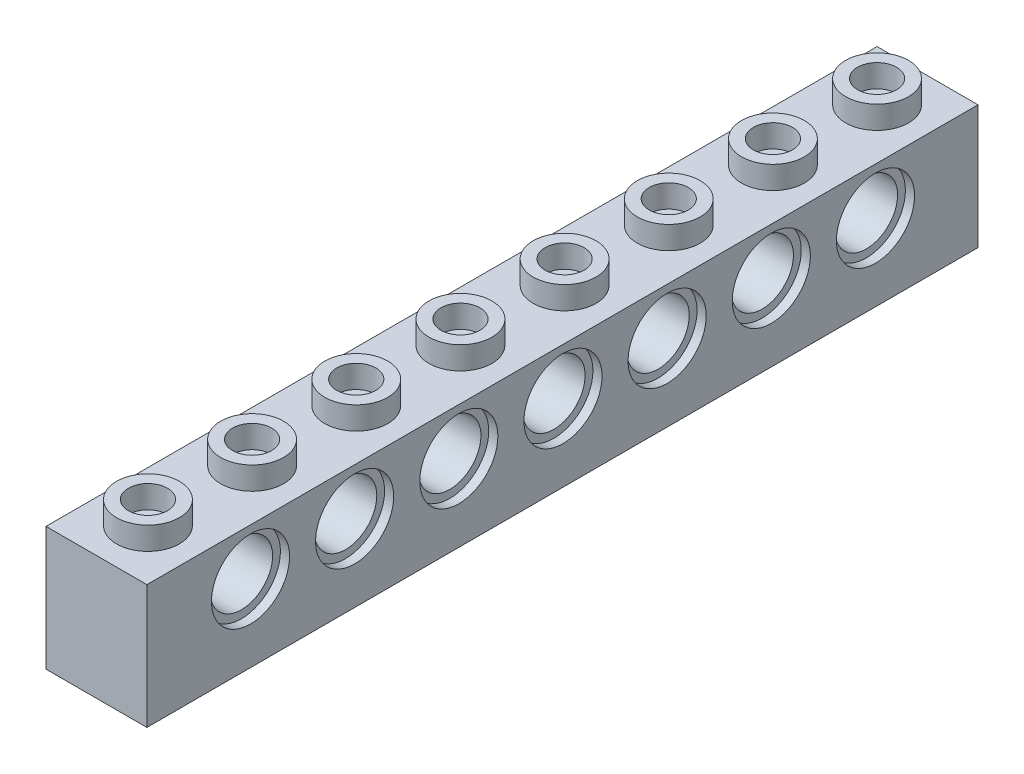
ISO-10303-21;
HEADER;
FILE_DESCRIPTION(('STEP AP214'),'2;1');
FILE_NAME('part.step','',(''),(''),'','','');
FILE_SCHEMA(('AUTOMOTIVE_DESIGN { 1 0 10303 214 1 1 1 1 }'));
ENDSEC;
DATA;
#1=APPLICATION_CONTEXT('core data for automotive mechanical design processes');
#2=APPLICATION_PROTOCOL_DEFINITION('international standard','automotive_design',2000,#1);
#3=PRODUCT_CONTEXT('',#1,'mechanical');
#4=PRODUCT('Part','Part','',(#3));
#5=PRODUCT_RELATED_PRODUCT_CATEGORY('part','',(#4));
#6=PRODUCT_DEFINITION_FORMATION('','',#4);
#7=PRODUCT_DEFINITION_CONTEXT('part definition',#1,'design');
#8=PRODUCT_DEFINITION('design','',#6,#7);
#9=PRODUCT_DEFINITION_SHAPE('','',#8);
#10=(LENGTH_UNIT() NAMED_UNIT(*) SI_UNIT(.MILLI.,.METRE.));
#11=(NAMED_UNIT(*) PLANE_ANGLE_UNIT() SI_UNIT($,.RADIAN.));
#12=(NAMED_UNIT(*) SI_UNIT($,.STERADIAN.) SOLID_ANGLE_UNIT());
#13=UNCERTAINTY_MEASURE_WITH_UNIT(LENGTH_MEASURE(1.E-05),#10,'distance_accuracy_value','');
#14=(GEOMETRIC_REPRESENTATION_CONTEXT(3) GLOBAL_UNCERTAINTY_ASSIGNED_CONTEXT((#13)) GLOBAL_UNIT_ASSIGNED_CONTEXT((#10,
#11,#12)) REPRESENTATION_CONTEXT('',''));
#15=CARTESIAN_POINT('',(0.,0.,0.));
#16=DIRECTION('',(0.,0.,1.));
#17=DIRECTION('',(1.,0.,0.));
#18=AXIS2_PLACEMENT_3D('',#15,#16,#17);
#19=CARTESIAN_POINT('',(-2.425,-3.,62.38));
#20=DIRECTION('',(0.,-1.,0.));
#21=DIRECTION('',(0.,0.,-1.));
#22=AXIS2_PLACEMENT_3D('',#19,#20,#21);
#23=PLANE('',#22);
#24=CARTESIAN_POINT('',(0.,-3.,16.23));
#25=DIRECTION('',(0.,-1.,0.));
#26=DIRECTION('',(0.,0.,-1.));
#27=AXIS2_PLACEMENT_3D('',#24,#25,#26);
#28=CIRCLE('',#27,1.5);
#29=CARTESIAN_POINT('',(0.,-3.,14.73));
#30=VERTEX_POINT('',#29);
#31=EDGE_CURVE('E404',#30,#30,#28,.T.);
#32=ORIENTED_EDGE('',*,*,#31,.F.);
#33=EDGE_LOOP('',(#32));
#34=FACE_BOUND('',#33,.T.);
#35=CARTESIAN_POINT('',(0.,-3.,32.23));
#36=DIRECTION('',(0.,-1.,0.));
#37=DIRECTION('',(0.,0.,-1.));
#38=AXIS2_PLACEMENT_3D('',#35,#36,#37);
#39=CIRCLE('',#38,1.5);
#40=CARTESIAN_POINT('',(0.,-3.,30.73));
#41=VERTEX_POINT('',#40);
#42=EDGE_CURVE('E416',#41,#41,#39,.T.);
#43=ORIENTED_EDGE('',*,*,#42,.F.);
#44=EDGE_LOOP('',(#43));
#45=FACE_BOUND('',#44,.T.);
#46=CARTESIAN_POINT('',(0.,-3.,48.23));
#47=DIRECTION('',(0.,-1.,0.));
#48=DIRECTION('',(0.,0.,-1.));
#49=AXIS2_PLACEMENT_3D('',#46,#47,#48);
#50=CIRCLE('',#49,1.5);
#51=CARTESIAN_POINT('',(0.,-3.,46.73));
#52=VERTEX_POINT('',#51);
#53=EDGE_CURVE('E428',#52,#52,#50,.T.);
#54=ORIENTED_EDGE('',*,*,#53,.F.);
#55=EDGE_LOOP('',(#54));
#56=FACE_BOUND('',#55,.T.);
#57=DIRECTION('',(-1.,0.,0.));
#58=VECTOR('',#57,1.);
#59=CARTESIAN_POINT('',(2.425,-3.,62.38));
#60=LINE('',#59,#58);
#61=CARTESIAN_POINT('',(2.425,-3.,62.38));
#62=VERTEX_POINT('',#61);
#63=CARTESIAN_POINT('',(-2.425,-3.,62.38));
#64=VERTEX_POINT('',#63);
#65=EDGE_CURVE('E118',#62,#64,#60,.T.);
#66=ORIENTED_EDGE('',*,*,#65,.T.);
#67=DIRECTION('',(0.,0.,-1.));
#68=VECTOR('',#67,1.);
#69=CARTESIAN_POINT('',(-2.425,-3.,62.38));
#70=LINE('',#69,#68);
#71=CARTESIAN_POINT('',(-2.425,-3.,1.45));
#72=VERTEX_POINT('',#71);
#73=EDGE_CURVE('E127',#64,#72,#70,.T.);
#74=ORIENTED_EDGE('',*,*,#73,.T.);
#75=DIRECTION('',(1.,0.,0.));
#76=VECTOR('',#75,1.);
#77=CARTESIAN_POINT('',(-2.425,-3.,1.45));
#78=LINE('',#77,#76);
#79=CARTESIAN_POINT('',(2.425,-3.,1.45));
#80=VERTEX_POINT('',#79);
#81=EDGE_CURVE('E132',#72,#80,#78,.T.);
#82=ORIENTED_EDGE('',*,*,#81,.T.);
#83=DIRECTION('',(0.,0.,1.));
#84=VECTOR('',#83,1.);
#85=CARTESIAN_POINT('',(2.425,-3.,1.45));
#86=LINE('',#85,#84);
#87=EDGE_CURVE('E124',#80,#62,#86,.T.);
#88=ORIENTED_EDGE('',*,*,#87,.T.);
#89=EDGE_LOOP('',(#66,#74,#82,#88));
#90=FACE_BOUND('',#89,.T.);
#91=CARTESIAN_POINT('',(0.,-3.,56.23));
#92=DIRECTION('',(0.,-1.,0.));
#93=DIRECTION('',(0.,0.,-1.));
#94=AXIS2_PLACEMENT_3D('',#91,#92,#93);
#95=CIRCLE('',#94,1.5);
#96=CARTESIAN_POINT('',(0.,-3.,54.73));
#97=VERTEX_POINT('',#96);
#98=EDGE_CURVE('E142',#97,#97,#95,.T.);
#99=ORIENTED_EDGE('',*,*,#98,.F.);
#100=EDGE_LOOP('',(#99));
#101=FACE_BOUND('',#100,.T.);
#102=CARTESIAN_POINT('',(0.,-3.,40.23));
#103=DIRECTION('',(0.,-1.,0.));
#104=DIRECTION('',(0.,0.,-1.));
#105=AXIS2_PLACEMENT_3D('',#102,#103,#104);
#106=CIRCLE('',#105,1.5);
#107=CARTESIAN_POINT('',(0.,-3.,38.73));
#108=VERTEX_POINT('',#107);
#109=EDGE_CURVE('E422',#108,#108,#106,.T.);
#110=ORIENTED_EDGE('',*,*,#109,.F.);
#111=EDGE_LOOP('',(#110));
#112=FACE_BOUND('',#111,.T.);
#113=CARTESIAN_POINT('',(0.,-3.,24.23));
#114=DIRECTION('',(0.,-1.,0.));
#115=DIRECTION('',(0.,0.,-1.));
#116=AXIS2_PLACEMENT_3D('',#113,#114,#115);
#117=CIRCLE('',#116,1.5);
#118=CARTESIAN_POINT('',(0.,-3.,22.73));
#119=VERTEX_POINT('',#118);
#120=EDGE_CURVE('E410',#119,#119,#117,.T.);
#121=ORIENTED_EDGE('',*,*,#120,.F.);
#122=EDGE_LOOP('',(#121));
#123=FACE_BOUND('',#122,.T.);
#124=CARTESIAN_POINT('',(0.,-3.,8.23));
#125=DIRECTION('',(0.,-1.,0.));
#126=DIRECTION('',(0.,0.,-1.));
#127=AXIS2_PLACEMENT_3D('',#124,#125,#126);
#128=CIRCLE('',#127,1.5);
#129=CARTESIAN_POINT('',(0.,-3.,6.72999999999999));
#130=VERTEX_POINT('',#129);
#131=EDGE_CURVE('E398',#130,#130,#128,.T.);
#132=ORIENTED_EDGE('',*,*,#131,.F.);
#133=EDGE_LOOP('',(#132));
#134=FACE_BOUND('',#133,.T.);
#135=ADVANCED_FACE('F39',(#34,#45,#56,#90,#101,#112,#123,#134),#23,.T.);
#136=CARTESIAN_POINT('',(3.875,4.75,63.83));
#137=DIRECTION('',(0.,-1.,0.));
#138=DIRECTION('',(1.,0.,0.));
#139=AXIS2_PLACEMENT_3D('',#136,#137,#138);
#140=PLANE('',#139);
#141=DIRECTION('',(-1.,0.,0.));
#142=VECTOR('',#141,1.);
#143=CARTESIAN_POINT('',(3.875,4.75,0.));
#144=LINE('',#143,#142);
#145=CARTESIAN_POINT('',(3.875,4.75,0.));
#146=VERTEX_POINT('',#145);
#147=CARTESIAN_POINT('',(-3.875,4.75,0.));
#148=VERTEX_POINT('',#147);
#149=EDGE_CURVE('E86',#146,#148,#144,.T.);
#150=ORIENTED_EDGE('',*,*,#149,.T.);
#151=DIRECTION('',(0.,0.,-1.));
#152=VECTOR('',#151,1.);
#153=CARTESIAN_POINT('',(-3.875,4.75,63.83));
#154=LINE('',#153,#152);
#155=CARTESIAN_POINT('',(-3.875,4.75,63.83));
#156=VERTEX_POINT('',#155);
#157=EDGE_CURVE('E237',#156,#148,#154,.T.);
#158=ORIENTED_EDGE('',*,*,#157,.F.);
#159=DIRECTION('',(-1.,0.,0.));
#160=VECTOR('',#159,1.);
#161=CARTESIAN_POINT('',(3.875,4.75,63.83));
#162=LINE('',#161,#160);
#163=CARTESIAN_POINT('',(3.875,4.75,63.83));
#164=VERTEX_POINT('',#163);
#165=EDGE_CURVE('E65',#164,#156,#162,.T.);
#166=ORIENTED_EDGE('',*,*,#165,.F.);
#167=DIRECTION('',(0.,0.,-1.));
#168=VECTOR('',#167,1.);
#169=CARTESIAN_POINT('',(3.875,4.75,63.83));
#170=LINE('',#169,#168);
#171=EDGE_CURVE('E246',#164,#146,#170,.T.);
#172=ORIENTED_EDGE('',*,*,#171,.T.);
#173=EDGE_LOOP('',(#150,#158,#166,#172));
#174=FACE_BOUND('',#173,.T.);
#175=CARTESIAN_POINT('',(0.,4.75,3.875));
#176=DIRECTION('',(0.,-1.,0.));
#177=DIRECTION('',(1.,0.,0.));
#178=AXIS2_PLACEMENT_3D('',#175,#176,#177);
#179=CIRCLE('',#178,2.415);
#180=CARTESIAN_POINT('',(2.415,4.75,3.875));
#181=VERTEX_POINT('',#180);
#182=EDGE_CURVE('E253',#181,#181,#179,.F.);
#183=ORIENTED_EDGE('',*,*,#182,.F.);
#184=EDGE_LOOP('',(#183));
#185=FACE_BOUND('',#184,.T.);
#186=CARTESIAN_POINT('',(0.,4.75,11.875));
#187=DIRECTION('',(0.,-1.,0.));
#188=DIRECTION('',(1.,0.,0.));
#189=AXIS2_PLACEMENT_3D('',#186,#187,#188);
#190=CIRCLE('',#189,2.415);
#191=CARTESIAN_POINT('',(2.415,4.75,11.875));
#192=VERTEX_POINT('',#191);
#193=EDGE_CURVE('E256',#192,#192,#190,.F.);
#194=ORIENTED_EDGE('',*,*,#193,.F.);
#195=EDGE_LOOP('',(#194));
#196=FACE_BOUND('',#195,.T.);
#197=CARTESIAN_POINT('',(0.,4.75,19.875));
#198=DIRECTION('',(0.,-1.,0.));
#199=DIRECTION('',(1.,0.,0.));
#200=AXIS2_PLACEMENT_3D('',#197,#198,#199);
#201=CIRCLE('',#200,2.415);
#202=CARTESIAN_POINT('',(2.415,4.75,19.875));
#203=VERTEX_POINT('',#202);
#204=EDGE_CURVE('E259',#203,#203,#201,.F.);
#205=ORIENTED_EDGE('',*,*,#204,.F.);
#206=EDGE_LOOP('',(#205));
#207=FACE_BOUND('',#206,.T.);
#208=CARTESIAN_POINT('',(0.,4.75,27.875));
#209=DIRECTION('',(0.,-1.,0.));
#210=DIRECTION('',(1.,0.,0.));
#211=AXIS2_PLACEMENT_3D('',#208,#209,#210);
#212=CIRCLE('',#211,2.415);
#213=CARTESIAN_POINT('',(2.415,4.75,27.875));
#214=VERTEX_POINT('',#213);
#215=EDGE_CURVE('E262',#214,#214,#212,.F.);
#216=ORIENTED_EDGE('',*,*,#215,.F.);
#217=EDGE_LOOP('',(#216));
#218=FACE_BOUND('',#217,.T.);
#219=CARTESIAN_POINT('',(0.,4.75,35.875));
#220=DIRECTION('',(0.,-1.,0.));
#221=DIRECTION('',(1.,0.,0.));
#222=AXIS2_PLACEMENT_3D('',#219,#220,#221);
#223=CIRCLE('',#222,2.415);
#224=CARTESIAN_POINT('',(2.415,4.75,35.875));
#225=VERTEX_POINT('',#224);
#226=EDGE_CURVE('E265',#225,#225,#223,.F.);
#227=ORIENTED_EDGE('',*,*,#226,.F.);
#228=EDGE_LOOP('',(#227));
#229=FACE_BOUND('',#228,.T.);
#230=CARTESIAN_POINT('',(0.,4.75,43.875));
#231=DIRECTION('',(0.,-1.,0.));
#232=DIRECTION('',(1.,0.,0.));
#233=AXIS2_PLACEMENT_3D('',#230,#231,#232);
#234=CIRCLE('',#233,2.415);
#235=CARTESIAN_POINT('',(2.415,4.75,43.875));
#236=VERTEX_POINT('',#235);
#237=EDGE_CURVE('E268',#236,#236,#234,.F.);
#238=ORIENTED_EDGE('',*,*,#237,.F.);
#239=EDGE_LOOP('',(#238));
#240=FACE_BOUND('',#239,.T.);
#241=CARTESIAN_POINT('',(0.,4.75,51.875));
#242=DIRECTION('',(0.,-1.,0.));
#243=DIRECTION('',(1.,0.,0.));
#244=AXIS2_PLACEMENT_3D('',#241,#242,#243);
#245=CIRCLE('',#244,2.415);
#246=CARTESIAN_POINT('',(2.415,4.75,51.875));
#247=VERTEX_POINT('',#246);
#248=EDGE_CURVE('E271',#247,#247,#245,.F.);
#249=ORIENTED_EDGE('',*,*,#248,.F.);
#250=EDGE_LOOP('',(#249));
#251=FACE_BOUND('',#250,.T.);
#252=CARTESIAN_POINT('',(0.,4.75,59.875));
#253=DIRECTION('',(0.,-1.,0.));
#254=DIRECTION('',(1.,0.,0.));
#255=AXIS2_PLACEMENT_3D('',#252,#253,#254);
#256=CIRCLE('',#255,2.415);
#257=CARTESIAN_POINT('',(2.415,4.75,59.875));
#258=VERTEX_POINT('',#257);
#259=EDGE_CURVE('E274',#258,#258,#256,.F.);
#260=ORIENTED_EDGE('',*,*,#259,.F.);
#261=EDGE_LOOP('',(#260));
#262=FACE_BOUND('',#261,.T.);
#263=ADVANCED_FACE('F444',(#174,#185,#196,#207,#218,#229,#240,#251,#262),#140,.F.);
#264=CARTESIAN_POINT('',(-3.875,-4.75,63.83));
#265=DIRECTION('',(1.,0.,0.));
#266=DIRECTION('',(0.,0.,-1.));
#267=AXIS2_PLACEMENT_3D('',#264,#265,#266);
#268=PLANE('',#267);
#269=CARTESIAN_POINT('',(-3.875,1.15,55.875));
#270=DIRECTION('',(-1.,0.,0.));
#271=DIRECTION('',(0.,0.,1.));
#272=AXIS2_PLACEMENT_3D('',#269,#270,#271);
#273=CIRCLE('',#272,3.);
#274=CARTESIAN_POINT('',(-3.875,1.15,58.875));
#275=VERTEX_POINT('',#274);
#276=EDGE_CURVE('E345',#275,#275,#273,.T.);
#277=ORIENTED_EDGE('',*,*,#276,.F.);
#278=EDGE_LOOP('',(#277));
#279=FACE_BOUND('',#278,.T.);
#280=CARTESIAN_POINT('',(-3.875,1.15,47.875));
#281=DIRECTION('',(-1.,0.,0.));
#282=DIRECTION('',(0.,0.,1.));
#283=AXIS2_PLACEMENT_3D('',#280,#281,#282);
#284=CIRCLE('',#283,3.);
#285=CARTESIAN_POINT('',(-3.875,1.15,50.875));
#286=VERTEX_POINT('',#285);
#287=EDGE_CURVE('E349',#286,#286,#284,.T.);
#288=ORIENTED_EDGE('',*,*,#287,.F.);
#289=EDGE_LOOP('',(#288));
#290=FACE_BOUND('',#289,.T.);
#291=CARTESIAN_POINT('',(-3.875,1.15,39.875));
#292=DIRECTION('',(-1.,0.,0.));
#293=DIRECTION('',(0.,0.,1.));
#294=AXIS2_PLACEMENT_3D('',#291,#292,#293);
#295=CIRCLE('',#294,3.);
#296=CARTESIAN_POINT('',(-3.875,1.15,42.875));
#297=VERTEX_POINT('',#296);
#298=EDGE_CURVE('E355',#297,#297,#295,.T.);
#299=ORIENTED_EDGE('',*,*,#298,.F.);
#300=EDGE_LOOP('',(#299));
#301=FACE_BOUND('',#300,.T.);
#302=CARTESIAN_POINT('',(-3.875,1.15,31.875));
#303=DIRECTION('',(-1.,0.,0.));
#304=DIRECTION('',(0.,0.,1.));
#305=AXIS2_PLACEMENT_3D('',#302,#303,#304);
#306=CIRCLE('',#305,3.);
#307=CARTESIAN_POINT('',(-3.875,1.15,34.875));
#308=VERTEX_POINT('',#307);
#309=EDGE_CURVE('E361',#308,#308,#306,.T.);
#310=ORIENTED_EDGE('',*,*,#309,.F.);
#311=EDGE_LOOP('',(#310));
#312=FACE_BOUND('',#311,.T.);
#313=CARTESIAN_POINT('',(-3.875,1.15,23.875));
#314=DIRECTION('',(-1.,0.,0.));
#315=DIRECTION('',(0.,0.,1.));
#316=AXIS2_PLACEMENT_3D('',#313,#314,#315);
#317=CIRCLE('',#316,3.);
#318=CARTESIAN_POINT('',(-3.875,1.15,26.875));
#319=VERTEX_POINT('',#318);
#320=EDGE_CURVE('E367',#319,#319,#317,.T.);
#321=ORIENTED_EDGE('',*,*,#320,.F.);
#322=EDGE_LOOP('',(#321));
#323=FACE_BOUND('',#322,.T.);
#324=CARTESIAN_POINT('',(-3.875,1.15,15.875));
#325=DIRECTION('',(-1.,0.,0.));
#326=DIRECTION('',(0.,0.,1.));
#327=AXIS2_PLACEMENT_3D('',#324,#325,#326);
#328=CIRCLE('',#327,3.);
#329=CARTESIAN_POINT('',(-3.875,1.15,18.875));
#330=VERTEX_POINT('',#329);
#331=EDGE_CURVE('E373',#330,#330,#328,.T.);
#332=ORIENTED_EDGE('',*,*,#331,.F.);
#333=EDGE_LOOP('',(#332));
#334=FACE_BOUND('',#333,.T.);
#335=CARTESIAN_POINT('',(-3.875,1.15,7.875));
#336=DIRECTION('',(-1.,0.,0.));
#337=DIRECTION('',(0.,0.,1.));
#338=AXIS2_PLACEMENT_3D('',#335,#336,#337);
#339=CIRCLE('',#338,3.);
#340=CARTESIAN_POINT('',(-3.875,1.15,10.875));
#341=VERTEX_POINT('',#340);
#342=EDGE_CURVE('E388',#341,#341,#339,.T.);
#343=ORIENTED_EDGE('',*,*,#342,.F.);
#344=EDGE_LOOP('',(#343));
#345=FACE_BOUND('',#344,.T.);
#346=DIRECTION('',(0.,-1.,0.));
#347=VECTOR('',#346,1.);
#348=CARTESIAN_POINT('',(-3.875,-4.75,0.));
#349=LINE('',#348,#347);
#350=CARTESIAN_POINT('',(-3.875,-4.75,0.));
#351=VERTEX_POINT('',#350);
#352=EDGE_CURVE('E230',#148,#351,#349,.T.);
#353=ORIENTED_EDGE('',*,*,#352,.T.);
#354=DIRECTION('',(0.,0.,-1.));
#355=VECTOR('',#354,1.);
#356=CARTESIAN_POINT('',(-3.875,-4.75,63.83));
#357=LINE('',#356,#355);
#358=CARTESIAN_POINT('',(-3.875,-4.75,63.83));
#359=VERTEX_POINT('',#358);
#360=EDGE_CURVE('E251',#359,#351,#357,.T.);
#361=ORIENTED_EDGE('',*,*,#360,.F.);
#362=DIRECTION('',(0.,-1.,0.));
#363=VECTOR('',#362,1.);
#364=CARTESIAN_POINT('',(-3.875,-4.75,63.83));
#365=LINE('',#364,#363);
#366=EDGE_CURVE('E231',#156,#359,#365,.T.);
#367=ORIENTED_EDGE('',*,*,#366,.F.);
#368=ORIENTED_EDGE('',*,*,#157,.T.);
#369=EDGE_LOOP('',(#353,#361,#367,#368));
#370=FACE_BOUND('',#369,.T.);
#371=ADVANCED_FACE('F646',(#279,#290,#301,#312,#323,#334,#345,#370),#268,.F.);
#372=CARTESIAN_POINT('',(3.875,-4.75,63.83));
#373=DIRECTION('',(0.,1.,0.));
#374=DIRECTION('',(0.,0.,1.));
#375=AXIS2_PLACEMENT_3D('',#372,#373,#374);
#376=PLANE('',#375);
#377=DIRECTION('',(0.,0.,-1.));
#378=VECTOR('',#377,1.);
#379=CARTESIAN_POINT('',(-2.425,-4.75,62.38));
#380=LINE('',#379,#378);
#381=CARTESIAN_POINT('',(-2.425,-4.75,62.38));
#382=VERTEX_POINT('',#381);
#383=CARTESIAN_POINT('',(-2.425,-4.75,1.45));
#384=VERTEX_POINT('',#383);
#385=EDGE_CURVE('E148',#382,#384,#380,.T.);
#386=ORIENTED_EDGE('',*,*,#385,.F.);
#387=DIRECTION('',(-1.,0.,0.));
#388=VECTOR('',#387,1.);
#389=CARTESIAN_POINT('',(2.425,-4.75,62.38));
#390=LINE('',#389,#388);
#391=CARTESIAN_POINT('',(2.425,-4.75,62.38));
#392=VERTEX_POINT('',#391);
#393=EDGE_CURVE('E56',#392,#382,#390,.T.);
#394=ORIENTED_EDGE('',*,*,#393,.F.);
#395=DIRECTION('',(0.,0.,1.));
#396=VECTOR('',#395,1.);
#397=CARTESIAN_POINT('',(2.425,-4.75,1.45));
#398=LINE('',#397,#396);
#399=CARTESIAN_POINT('',(2.425,-4.75,1.45));
#400=VERTEX_POINT('',#399);
#401=EDGE_CURVE('E136',#400,#392,#398,.T.);
#402=ORIENTED_EDGE('',*,*,#401,.F.);
#403=DIRECTION('',(1.,0.,0.));
#404=VECTOR('',#403,1.);
#405=CARTESIAN_POINT('',(-2.425,-4.75,1.45));
#406=LINE('',#405,#404);
#407=EDGE_CURVE('E139',#384,#400,#406,.T.);
#408=ORIENTED_EDGE('',*,*,#407,.F.);
#409=EDGE_LOOP('',(#386,#394,#402,#408));
#410=FACE_BOUND('',#409,.T.);
#411=DIRECTION('',(1.,0.,0.));
#412=VECTOR('',#411,1.);
#413=CARTESIAN_POINT('',(3.875,-4.75,0.));
#414=LINE('',#413,#412);
#415=CARTESIAN_POINT('',(3.875,-4.75,0.));
#416=VERTEX_POINT('',#415);
#417=EDGE_CURVE('E240',#351,#416,#414,.T.);
#418=ORIENTED_EDGE('',*,*,#417,.T.);
#419=DIRECTION('',(0.,0.,-1.));
#420=VECTOR('',#419,1.);
#421=CARTESIAN_POINT('',(3.875,-4.75,63.83));
#422=LINE('',#421,#420);
#423=CARTESIAN_POINT('',(3.875,-4.75,63.83));
#424=VERTEX_POINT('',#423);
#425=EDGE_CURVE('E248',#424,#416,#422,.T.);
#426=ORIENTED_EDGE('',*,*,#425,.F.);
#427=DIRECTION('',(1.,0.,0.));
#428=VECTOR('',#427,1.);
#429=CARTESIAN_POINT('',(3.875,-4.75,63.83));
#430=LINE('',#429,#428);
#431=EDGE_CURVE('E94',#359,#424,#430,.T.);
#432=ORIENTED_EDGE('',*,*,#431,.F.);
#433=ORIENTED_EDGE('',*,*,#360,.T.);
#434=EDGE_LOOP('',(#418,#426,#432,#433));
#435=FACE_BOUND('',#434,.T.);
#436=ADVANCED_FACE('F642',(#410,#435),#376,.F.);
#437=CARTESIAN_POINT('',(3.875,-4.75,63.83));
#438=DIRECTION('',(-1.,0.,0.));
#439=DIRECTION('',(0.,0.,1.));
#440=AXIS2_PLACEMENT_3D('',#437,#438,#439);
#441=PLANE('',#440);
#442=CARTESIAN_POINT('',(3.875,1.15,15.875));
#443=DIRECTION('',(1.,0.,0.));
#444=DIRECTION('',(0.,0.,-1.));
#445=AXIS2_PLACEMENT_3D('',#442,#443,#444);
#446=CIRCLE('',#445,3.);
#447=CARTESIAN_POINT('',(3.875,1.15,12.875));
#448=VERTEX_POINT('',#447);
#449=EDGE_CURVE('E379',#448,#448,#446,.T.);
#450=ORIENTED_EDGE('',*,*,#449,.F.);
#451=EDGE_LOOP('',(#450));
#452=FACE_BOUND('',#451,.T.);
#453=CARTESIAN_POINT('',(3.875,1.15,7.875));
#454=DIRECTION('',(1.,0.,0.));
#455=DIRECTION('',(0.,0.,-1.));
#456=AXIS2_PLACEMENT_3D('',#453,#454,#455);
#457=CIRCLE('',#456,3.);
#458=CARTESIAN_POINT('',(3.875,1.15,4.875));
#459=VERTEX_POINT('',#458);
#460=EDGE_CURVE('E392',#459,#459,#457,.T.);
#461=ORIENTED_EDGE('',*,*,#460,.F.);
#462=EDGE_LOOP('',(#461));
#463=FACE_BOUND('',#462,.T.);
#464=DIRECTION('',(0.,1.,0.));
#465=VECTOR('',#464,1.);
#466=CARTESIAN_POINT('',(3.875,-4.75,0.));
#467=LINE('',#466,#465);
#468=EDGE_CURVE('E242',#416,#146,#467,.T.);
#469=ORIENTED_EDGE('',*,*,#468,.T.);
#470=ORIENTED_EDGE('',*,*,#171,.F.);
#471=DIRECTION('',(0.,1.,0.));
#472=VECTOR('',#471,1.);
#473=CARTESIAN_POINT('',(3.875,-4.75,63.83));
#474=LINE('',#473,#472);
#475=EDGE_CURVE('E234',#424,#164,#474,.T.);
#476=ORIENTED_EDGE('',*,*,#475,.F.);
#477=ORIENTED_EDGE('',*,*,#425,.T.);
#478=EDGE_LOOP('',(#469,#470,#476,#477));
#479=FACE_BOUND('',#478,.T.);
#480=CARTESIAN_POINT('',(3.875,1.15,23.875));
#481=DIRECTION('',(1.,0.,0.));
#482=DIRECTION('',(0.,0.,-1.));
#483=AXIS2_PLACEMENT_3D('',#480,#481,#482);
#484=CIRCLE('',#483,3.);
#485=CARTESIAN_POINT('',(3.875,1.15,20.875));
#486=VERTEX_POINT('',#485);
#487=EDGE_CURVE('E277',#486,#486,#484,.T.);
#488=ORIENTED_EDGE('',*,*,#487,.F.);
#489=EDGE_LOOP('',(#488));
#490=FACE_BOUND('',#489,.T.);
#491=CARTESIAN_POINT('',(3.875,1.15,31.875));
#492=DIRECTION('',(1.,0.,0.));
#493=DIRECTION('',(0.,0.,-1.));
#494=AXIS2_PLACEMENT_3D('',#491,#492,#493);
#495=CIRCLE('',#494,3.);
#496=CARTESIAN_POINT('',(3.875,1.15,28.875));
#497=VERTEX_POINT('',#496);
#498=EDGE_CURVE('E288',#497,#497,#495,.T.);
#499=ORIENTED_EDGE('',*,*,#498,.F.);
#500=EDGE_LOOP('',(#499));
#501=FACE_BOUND('',#500,.T.);
#502=CARTESIAN_POINT('',(3.875,1.15,39.875));
#503=DIRECTION('',(1.,0.,0.));
#504=DIRECTION('',(0.,0.,-1.));
#505=AXIS2_PLACEMENT_3D('',#502,#503,#504);
#506=CIRCLE('',#505,3.);
#507=CARTESIAN_POINT('',(3.875,1.15,36.875));
#508=VERTEX_POINT('',#507);
#509=EDGE_CURVE('E294',#508,#508,#506,.T.);
#510=ORIENTED_EDGE('',*,*,#509,.F.);
#511=EDGE_LOOP('',(#510));
#512=FACE_BOUND('',#511,.T.);
#513=CARTESIAN_POINT('',(3.875,1.15,47.875));
#514=DIRECTION('',(1.,0.,0.));
#515=DIRECTION('',(0.,0.,-1.));
#516=AXIS2_PLACEMENT_3D('',#513,#514,#515);
#517=CIRCLE('',#516,3.);
#518=CARTESIAN_POINT('',(3.875,1.15,44.875));
#519=VERTEX_POINT('',#518);
#520=EDGE_CURVE('E300',#519,#519,#517,.T.);
#521=ORIENTED_EDGE('',*,*,#520,.F.);
#522=EDGE_LOOP('',(#521));
#523=FACE_BOUND('',#522,.T.);
#524=CARTESIAN_POINT('',(3.875,1.15,55.875));
#525=DIRECTION('',(1.,0.,0.));
#526=DIRECTION('',(0.,0.,-1.));
#527=AXIS2_PLACEMENT_3D('',#524,#525,#526);
#528=CIRCLE('',#527,3.);
#529=CARTESIAN_POINT('',(3.875,1.15,52.875));
#530=VERTEX_POINT('',#529);
#531=EDGE_CURVE('E48',#530,#530,#528,.T.);
#532=ORIENTED_EDGE('',*,*,#531,.F.);
#533=EDGE_LOOP('',(#532));
#534=FACE_BOUND('',#533,.T.);
#535=ADVANCED_FACE('F633',(#452,#463,#479,#490,#501,#512,#523,#534),#441,.F.);
#536=CARTESIAN_POINT('',(-3.875,4.75,63.83));
#537=DIRECTION('',(0.,0.,1.));
#538=DIRECTION('',(1.,0.,0.));
#539=AXIS2_PLACEMENT_3D('',#536,#537,#538);
#540=PLANE('',#539);
#541=ORIENTED_EDGE('',*,*,#366,.T.);
#542=ORIENTED_EDGE('',*,*,#431,.T.);
#543=ORIENTED_EDGE('',*,*,#475,.T.);
#544=ORIENTED_EDGE('',*,*,#165,.T.);
#545=EDGE_LOOP('',(#541,#542,#543,#544));
#546=FACE_BOUND('',#545,.T.);
#547=ADVANCED_FACE('F630',(#546),#540,.T.);
#548=CARTESIAN_POINT('',(-3.875,4.75,0.));
#549=DIRECTION('',(0.,0.,1.));
#550=DIRECTION('',(1.,0.,0.));
#551=AXIS2_PLACEMENT_3D('',#548,#549,#550);
#552=PLANE('',#551);
#553=ORIENTED_EDGE('',*,*,#352,.F.);
#554=ORIENTED_EDGE('',*,*,#149,.F.);
#555=ORIENTED_EDGE('',*,*,#468,.F.);
#556=ORIENTED_EDGE('',*,*,#417,.F.);
#557=EDGE_LOOP('',(#553,#554,#555,#556));
#558=FACE_BOUND('',#557,.T.);
#559=ADVANCED_FACE('F625',(#558),#552,.F.);
#560=CARTESIAN_POINT('',(0.,6.5,3.875));
#561=DIRECTION('',(0.,1.,0.));
#562=DIRECTION('',(-1.,0.,0.));
#563=AXIS2_PLACEMENT_3D('',#560,#561,#562);
#564=PLANE('',#563);
#565=CARTESIAN_POINT('',(0.,6.5,3.875));
#566=DIRECTION('',(0.,1.,0.));
#567=DIRECTION('',(-1.,0.,0.));
#568=AXIS2_PLACEMENT_3D('',#565,#566,#567);
#569=CIRCLE('',#568,2.415);
#570=CARTESIAN_POINT('',(-2.415,6.5,3.875));
#571=VERTEX_POINT('',#570);
#572=EDGE_CURVE('E225',#571,#571,#569,.T.);
#573=ORIENTED_EDGE('',*,*,#572,.T.);
#574=EDGE_LOOP('',(#573));
#575=FACE_BOUND('',#574,.T.);
#576=CARTESIAN_POINT('',(0.,6.5,3.875));
#577=DIRECTION('',(0.,1.,0.));
#578=DIRECTION('',(-1.,0.,0.));
#579=AXIS2_PLACEMENT_3D('',#576,#577,#578);
#580=CIRCLE('',#579,1.5);
#581=CARTESIAN_POINT('',(-1.5,6.5,3.875));
#582=VERTEX_POINT('',#581);
#583=EDGE_CURVE('E222',#582,#582,#580,.T.);
#584=ORIENTED_EDGE('',*,*,#583,.F.);
#585=EDGE_LOOP('',(#584));
#586=FACE_BOUND('',#585,.T.);
#587=ADVANCED_FACE('F622',(#575,#586),#564,.T.);
#588=CARTESIAN_POINT('',(0.,6.5,3.875));
#589=DIRECTION('',(0.,-1.,0.));
#590=DIRECTION('',(1.,0.,0.));
#591=AXIS2_PLACEMENT_3D('',#588,#589,#590);
#592=CYLINDRICAL_SURFACE('',#591,2.415);
#593=ORIENTED_EDGE('',*,*,#572,.F.);
#594=EDGE_LOOP('',(#593));
#595=FACE_BOUND('',#594,.T.);
#596=ORIENTED_EDGE('',*,*,#182,.T.);
#597=EDGE_LOOP('',(#596));
#598=FACE_BOUND('',#597,.T.);
#599=ADVANCED_FACE('F620',(#595,#598),#592,.T.);
#600=CARTESIAN_POINT('',(0.,6.5,3.875));
#601=DIRECTION('',(0.,-1.,0.));
#602=DIRECTION('',(1.,0.,0.));
#603=AXIS2_PLACEMENT_3D('',#600,#601,#602);
#604=CYLINDRICAL_SURFACE('',#603,1.5);
#605=ORIENTED_EDGE('',*,*,#583,.T.);
#606=EDGE_LOOP('',(#605));
#607=FACE_BOUND('',#606,.T.);
#608=CARTESIAN_POINT('',(0.,4.75,3.875));
#609=DIRECTION('',(0.,1.,0.));
#610=DIRECTION('',(-1.,0.,0.));
#611=AXIS2_PLACEMENT_3D('',#608,#609,#610);
#612=CIRCLE('',#611,1.5);
#613=CARTESIAN_POINT('',(-1.5,4.75,3.875));
#614=VERTEX_POINT('',#613);
#615=EDGE_CURVE('E221',#614,#614,#612,.T.);
#616=ORIENTED_EDGE('',*,*,#615,.F.);
#617=EDGE_LOOP('',(#616));
#618=FACE_BOUND('',#617,.T.);
#619=ADVANCED_FACE('F617',(#607,#618),#604,.F.);
#620=ORIENTED_EDGE('',*,*,#615,.T.);
#621=EDGE_LOOP('',(#620));
#622=FACE_BOUND('',#621,.T.);
#623=ADVANCED_FACE('F612',(#622),#140,.F.);
#624=CARTESIAN_POINT('',(0.,6.5,11.875));
#625=DIRECTION('',(0.,1.,0.));
#626=DIRECTION('',(-1.,0.,0.));
#627=AXIS2_PLACEMENT_3D('',#624,#625,#626);
#628=PLANE('',#627);
#629=CARTESIAN_POINT('',(0.,6.5,11.875));
#630=DIRECTION('',(0.,1.,0.));
#631=DIRECTION('',(-1.,0.,0.));
#632=AXIS2_PLACEMENT_3D('',#629,#630,#631);
#633=CIRCLE('',#632,2.415);
#634=CARTESIAN_POINT('',(-2.415,6.5,11.875));
#635=VERTEX_POINT('',#634);
#636=EDGE_CURVE('E216',#635,#635,#633,.T.);
#637=ORIENTED_EDGE('',*,*,#636,.T.);
#638=EDGE_LOOP('',(#637));
#639=FACE_BOUND('',#638,.T.);
#640=CARTESIAN_POINT('',(0.,6.5,11.875));
#641=DIRECTION('',(0.,1.,0.));
#642=DIRECTION('',(-1.,0.,0.));
#643=AXIS2_PLACEMENT_3D('',#640,#641,#642);
#644=CIRCLE('',#643,1.5);
#645=CARTESIAN_POINT('',(-1.5,6.5,11.875));
#646=VERTEX_POINT('',#645);
#647=EDGE_CURVE('E213',#646,#646,#644,.T.);
#648=ORIENTED_EDGE('',*,*,#647,.F.);
#649=EDGE_LOOP('',(#648));
#650=FACE_BOUND('',#649,.T.);
#651=ADVANCED_FACE('F609',(#639,#650),#628,.T.);
#652=CARTESIAN_POINT('',(0.,6.5,11.875));
#653=DIRECTION('',(0.,-1.,0.));
#654=DIRECTION('',(1.,0.,0.));
#655=AXIS2_PLACEMENT_3D('',#652,#653,#654);
#656=CYLINDRICAL_SURFACE('',#655,2.415);
#657=ORIENTED_EDGE('',*,*,#636,.F.);
#658=EDGE_LOOP('',(#657));
#659=FACE_BOUND('',#658,.T.);
#660=ORIENTED_EDGE('',*,*,#193,.T.);
#661=EDGE_LOOP('',(#660));
#662=FACE_BOUND('',#661,.T.);
#663=ADVANCED_FACE('F607',(#659,#662),#656,.T.);
#664=CARTESIAN_POINT('',(0.,6.5,11.875));
#665=DIRECTION('',(0.,-1.,0.));
#666=DIRECTION('',(1.,0.,0.));
#667=AXIS2_PLACEMENT_3D('',#664,#665,#666);
#668=CYLINDRICAL_SURFACE('',#667,1.5);
#669=ORIENTED_EDGE('',*,*,#647,.T.);
#670=EDGE_LOOP('',(#669));
#671=FACE_BOUND('',#670,.T.);
#672=CARTESIAN_POINT('',(0.,4.75,11.875));
#673=DIRECTION('',(0.,1.,0.));
#674=DIRECTION('',(-1.,0.,0.));
#675=AXIS2_PLACEMENT_3D('',#672,#673,#674);
#676=CIRCLE('',#675,1.5);
#677=CARTESIAN_POINT('',(-1.5,4.75,11.875));
#678=VERTEX_POINT('',#677);
#679=EDGE_CURVE('E212',#678,#678,#676,.T.);
#680=ORIENTED_EDGE('',*,*,#679,.F.);
#681=EDGE_LOOP('',(#680));
#682=FACE_BOUND('',#681,.T.);
#683=ADVANCED_FACE('F604',(#671,#682),#668,.F.);
#684=ORIENTED_EDGE('',*,*,#679,.T.);
#685=EDGE_LOOP('',(#684));
#686=FACE_BOUND('',#685,.T.);
#687=ADVANCED_FACE('F599',(#686),#140,.F.);
#688=CARTESIAN_POINT('',(0.,6.5,19.875));
#689=DIRECTION('',(0.,1.,0.));
#690=DIRECTION('',(-1.,0.,0.));
#691=AXIS2_PLACEMENT_3D('',#688,#689,#690);
#692=PLANE('',#691);
#693=CARTESIAN_POINT('',(0.,6.5,19.875));
#694=DIRECTION('',(0.,1.,0.));
#695=DIRECTION('',(-1.,0.,0.));
#696=AXIS2_PLACEMENT_3D('',#693,#694,#695);
#697=CIRCLE('',#696,2.415);
#698=CARTESIAN_POINT('',(-2.415,6.5,19.875));
#699=VERTEX_POINT('',#698);
#700=EDGE_CURVE('E207',#699,#699,#697,.T.);
#701=ORIENTED_EDGE('',*,*,#700,.T.);
#702=EDGE_LOOP('',(#701));
#703=FACE_BOUND('',#702,.T.);
#704=CARTESIAN_POINT('',(0.,6.5,19.875));
#705=DIRECTION('',(0.,1.,0.));
#706=DIRECTION('',(-1.,0.,0.));
#707=AXIS2_PLACEMENT_3D('',#704,#705,#706);
#708=CIRCLE('',#707,1.5);
#709=CARTESIAN_POINT('',(-1.5,6.5,19.875));
#710=VERTEX_POINT('',#709);
#711=EDGE_CURVE('E204',#710,#710,#708,.T.);
#712=ORIENTED_EDGE('',*,*,#711,.F.);
#713=EDGE_LOOP('',(#712));
#714=FACE_BOUND('',#713,.T.);
#715=ADVANCED_FACE('F596',(#703,#714),#692,.T.);
#716=CARTESIAN_POINT('',(0.,6.5,19.875));
#717=DIRECTION('',(0.,-1.,0.));
#718=DIRECTION('',(1.,0.,0.));
#719=AXIS2_PLACEMENT_3D('',#716,#717,#718);
#720=CYLINDRICAL_SURFACE('',#719,2.415);
#721=ORIENTED_EDGE('',*,*,#700,.F.);
#722=EDGE_LOOP('',(#721));
#723=FACE_BOUND('',#722,.T.);
#724=ORIENTED_EDGE('',*,*,#204,.T.);
#725=EDGE_LOOP('',(#724));
#726=FACE_BOUND('',#725,.T.);
#727=ADVANCED_FACE('F594',(#723,#726),#720,.T.);
#728=CARTESIAN_POINT('',(0.,6.5,19.875));
#729=DIRECTION('',(0.,-1.,0.));
#730=DIRECTION('',(1.,0.,0.));
#731=AXIS2_PLACEMENT_3D('',#728,#729,#730);
#732=CYLINDRICAL_SURFACE('',#731,1.5);
#733=ORIENTED_EDGE('',*,*,#711,.T.);
#734=EDGE_LOOP('',(#733));
#735=FACE_BOUND('',#734,.T.);
#736=CARTESIAN_POINT('',(0.,4.75,19.875));
#737=DIRECTION('',(0.,1.,0.));
#738=DIRECTION('',(-1.,0.,0.));
#739=AXIS2_PLACEMENT_3D('',#736,#737,#738);
#740=CIRCLE('',#739,1.5);
#741=CARTESIAN_POINT('',(-1.5,4.75,19.875));
#742=VERTEX_POINT('',#741);
#743=EDGE_CURVE('E203',#742,#742,#740,.T.);
#744=ORIENTED_EDGE('',*,*,#743,.F.);
#745=EDGE_LOOP('',(#744));
#746=FACE_BOUND('',#745,.T.);
#747=ADVANCED_FACE('F591',(#735,#746),#732,.F.);
#748=ORIENTED_EDGE('',*,*,#743,.T.);
#749=EDGE_LOOP('',(#748));
#750=FACE_BOUND('',#749,.T.);
#751=ADVANCED_FACE('F586',(#750),#140,.F.);
#752=CARTESIAN_POINT('',(0.,6.5,27.875));
#753=DIRECTION('',(0.,1.,0.));
#754=DIRECTION('',(-1.,0.,0.));
#755=AXIS2_PLACEMENT_3D('',#752,#753,#754);
#756=PLANE('',#755);
#757=CARTESIAN_POINT('',(0.,6.5,27.875));
#758=DIRECTION('',(0.,1.,0.));
#759=DIRECTION('',(-1.,0.,0.));
#760=AXIS2_PLACEMENT_3D('',#757,#758,#759);
#761=CIRCLE('',#760,2.415);
#762=CARTESIAN_POINT('',(-2.415,6.5,27.875));
#763=VERTEX_POINT('',#762);
#764=EDGE_CURVE('E198',#763,#763,#761,.T.);
#765=ORIENTED_EDGE('',*,*,#764,.T.);
#766=EDGE_LOOP('',(#765));
#767=FACE_BOUND('',#766,.T.);
#768=CARTESIAN_POINT('',(0.,6.5,27.875));
#769=DIRECTION('',(0.,1.,0.));
#770=DIRECTION('',(-1.,0.,0.));
#771=AXIS2_PLACEMENT_3D('',#768,#769,#770);
#772=CIRCLE('',#771,1.5);
#773=CARTESIAN_POINT('',(-1.5,6.5,27.875));
#774=VERTEX_POINT('',#773);
#775=EDGE_CURVE('E195',#774,#774,#772,.T.);
#776=ORIENTED_EDGE('',*,*,#775,.F.);
#777=EDGE_LOOP('',(#776));
#778=FACE_BOUND('',#777,.T.);
#779=ADVANCED_FACE('F583',(#767,#778),#756,.T.);
#780=CARTESIAN_POINT('',(0.,6.5,27.875));
#781=DIRECTION('',(0.,-1.,0.));
#782=DIRECTION('',(1.,0.,0.));
#783=AXIS2_PLACEMENT_3D('',#780,#781,#782);
#784=CYLINDRICAL_SURFACE('',#783,2.415);
#785=ORIENTED_EDGE('',*,*,#764,.F.);
#786=EDGE_LOOP('',(#785));
#787=FACE_BOUND('',#786,.T.);
#788=ORIENTED_EDGE('',*,*,#215,.T.);
#789=EDGE_LOOP('',(#788));
#790=FACE_BOUND('',#789,.T.);
#791=ADVANCED_FACE('F581',(#787,#790),#784,.T.);
#792=CARTESIAN_POINT('',(0.,6.5,27.875));
#793=DIRECTION('',(0.,-1.,0.));
#794=DIRECTION('',(1.,0.,0.));
#795=AXIS2_PLACEMENT_3D('',#792,#793,#794);
#796=CYLINDRICAL_SURFACE('',#795,1.5);
#797=ORIENTED_EDGE('',*,*,#775,.T.);
#798=EDGE_LOOP('',(#797));
#799=FACE_BOUND('',#798,.T.);
#800=CARTESIAN_POINT('',(0.,4.75,27.875));
#801=DIRECTION('',(0.,1.,0.));
#802=DIRECTION('',(-1.,0.,0.));
#803=AXIS2_PLACEMENT_3D('',#800,#801,#802);
#804=CIRCLE('',#803,1.5);
#805=CARTESIAN_POINT('',(-1.5,4.75,27.875));
#806=VERTEX_POINT('',#805);
#807=EDGE_CURVE('E194',#806,#806,#804,.T.);
#808=ORIENTED_EDGE('',*,*,#807,.F.);
#809=EDGE_LOOP('',(#808));
#810=FACE_BOUND('',#809,.T.);
#811=ADVANCED_FACE('F578',(#799,#810),#796,.F.);
#812=ORIENTED_EDGE('',*,*,#807,.T.);
#813=EDGE_LOOP('',(#812));
#814=FACE_BOUND('',#813,.T.);
#815=ADVANCED_FACE('F573',(#814),#140,.F.);
#816=CARTESIAN_POINT('',(0.,6.5,35.875));
#817=DIRECTION('',(0.,1.,0.));
#818=DIRECTION('',(-1.,0.,0.));
#819=AXIS2_PLACEMENT_3D('',#816,#817,#818);
#820=PLANE('',#819);
#821=CARTESIAN_POINT('',(0.,6.5,35.875));
#822=DIRECTION('',(0.,1.,0.));
#823=DIRECTION('',(-1.,0.,0.));
#824=AXIS2_PLACEMENT_3D('',#821,#822,#823);
#825=CIRCLE('',#824,2.415);
#826=CARTESIAN_POINT('',(-2.415,6.5,35.875));
#827=VERTEX_POINT('',#826);
#828=EDGE_CURVE('E189',#827,#827,#825,.T.);
#829=ORIENTED_EDGE('',*,*,#828,.T.);
#830=EDGE_LOOP('',(#829));
#831=FACE_BOUND('',#830,.T.);
#832=CARTESIAN_POINT('',(0.,6.5,35.875));
#833=DIRECTION('',(0.,1.,0.));
#834=DIRECTION('',(-1.,0.,0.));
#835=AXIS2_PLACEMENT_3D('',#832,#833,#834);
#836=CIRCLE('',#835,1.5);
#837=CARTESIAN_POINT('',(-1.5,6.5,35.875));
#838=VERTEX_POINT('',#837);
#839=EDGE_CURVE('E186',#838,#838,#836,.T.);
#840=ORIENTED_EDGE('',*,*,#839,.F.);
#841=EDGE_LOOP('',(#840));
#842=FACE_BOUND('',#841,.T.);
#843=ADVANCED_FACE('F570',(#831,#842),#820,.T.);
#844=CARTESIAN_POINT('',(0.,6.5,35.875));
#845=DIRECTION('',(0.,-1.,0.));
#846=DIRECTION('',(1.,0.,0.));
#847=AXIS2_PLACEMENT_3D('',#844,#845,#846);
#848=CYLINDRICAL_SURFACE('',#847,2.415);
#849=ORIENTED_EDGE('',*,*,#828,.F.);
#850=EDGE_LOOP('',(#849));
#851=FACE_BOUND('',#850,.T.);
#852=ORIENTED_EDGE('',*,*,#226,.T.);
#853=EDGE_LOOP('',(#852));
#854=FACE_BOUND('',#853,.T.);
#855=ADVANCED_FACE('F568',(#851,#854),#848,.T.);
#856=CARTESIAN_POINT('',(0.,6.5,35.875));
#857=DIRECTION('',(0.,-1.,0.));
#858=DIRECTION('',(1.,0.,0.));
#859=AXIS2_PLACEMENT_3D('',#856,#857,#858);
#860=CYLINDRICAL_SURFACE('',#859,1.5);
#861=ORIENTED_EDGE('',*,*,#839,.T.);
#862=EDGE_LOOP('',(#861));
#863=FACE_BOUND('',#862,.T.);
#864=CARTESIAN_POINT('',(0.,4.75,35.875));
#865=DIRECTION('',(0.,1.,0.));
#866=DIRECTION('',(-1.,0.,0.));
#867=AXIS2_PLACEMENT_3D('',#864,#865,#866);
#868=CIRCLE('',#867,1.5);
#869=CARTESIAN_POINT('',(-1.5,4.75,35.875));
#870=VERTEX_POINT('',#869);
#871=EDGE_CURVE('E185',#870,#870,#868,.T.);
#872=ORIENTED_EDGE('',*,*,#871,.F.);
#873=EDGE_LOOP('',(#872));
#874=FACE_BOUND('',#873,.T.);
#875=ADVANCED_FACE('F565',(#863,#874),#860,.F.);
#876=ORIENTED_EDGE('',*,*,#871,.T.);
#877=EDGE_LOOP('',(#876));
#878=FACE_BOUND('',#877,.T.);
#879=ADVANCED_FACE('F560',(#878),#140,.F.);
#880=CARTESIAN_POINT('',(0.,6.5,43.875));
#881=DIRECTION('',(0.,1.,0.));
#882=DIRECTION('',(-1.,0.,0.));
#883=AXIS2_PLACEMENT_3D('',#880,#881,#882);
#884=PLANE('',#883);
#885=CARTESIAN_POINT('',(0.,6.5,43.875));
#886=DIRECTION('',(0.,1.,0.));
#887=DIRECTION('',(-1.,0.,0.));
#888=AXIS2_PLACEMENT_3D('',#885,#886,#887);
#889=CIRCLE('',#888,2.415);
#890=CARTESIAN_POINT('',(-2.415,6.5,43.875));
#891=VERTEX_POINT('',#890);
#892=EDGE_CURVE('E180',#891,#891,#889,.T.);
#893=ORIENTED_EDGE('',*,*,#892,.T.);
#894=EDGE_LOOP('',(#893));
#895=FACE_BOUND('',#894,.T.);
#896=CARTESIAN_POINT('',(0.,6.5,43.875));
#897=DIRECTION('',(0.,1.,0.));
#898=DIRECTION('',(-1.,0.,0.));
#899=AXIS2_PLACEMENT_3D('',#896,#897,#898);
#900=CIRCLE('',#899,1.5);
#901=CARTESIAN_POINT('',(-1.5,6.5,43.875));
#902=VERTEX_POINT('',#901);
#903=EDGE_CURVE('E177',#902,#902,#900,.T.);
#904=ORIENTED_EDGE('',*,*,#903,.F.);
#905=EDGE_LOOP('',(#904));
#906=FACE_BOUND('',#905,.T.);
#907=ADVANCED_FACE('F557',(#895,#906),#884,.T.);
#908=CARTESIAN_POINT('',(0.,6.5,43.875));
#909=DIRECTION('',(0.,-1.,0.));
#910=DIRECTION('',(1.,0.,0.));
#911=AXIS2_PLACEMENT_3D('',#908,#909,#910);
#912=CYLINDRICAL_SURFACE('',#911,2.415);
#913=ORIENTED_EDGE('',*,*,#892,.F.);
#914=EDGE_LOOP('',(#913));
#915=FACE_BOUND('',#914,.T.);
#916=ORIENTED_EDGE('',*,*,#237,.T.);
#917=EDGE_LOOP('',(#916));
#918=FACE_BOUND('',#917,.T.);
#919=ADVANCED_FACE('F555',(#915,#918),#912,.T.);
#920=CARTESIAN_POINT('',(0.,6.5,43.875));
#921=DIRECTION('',(0.,-1.,0.));
#922=DIRECTION('',(1.,0.,0.));
#923=AXIS2_PLACEMENT_3D('',#920,#921,#922);
#924=CYLINDRICAL_SURFACE('',#923,1.5);
#925=ORIENTED_EDGE('',*,*,#903,.T.);
#926=EDGE_LOOP('',(#925));
#927=FACE_BOUND('',#926,.T.);
#928=CARTESIAN_POINT('',(0.,4.75,43.875));
#929=DIRECTION('',(0.,1.,0.));
#930=DIRECTION('',(-1.,0.,0.));
#931=AXIS2_PLACEMENT_3D('',#928,#929,#930);
#932=CIRCLE('',#931,1.5);
#933=CARTESIAN_POINT('',(-1.5,4.75,43.875));
#934=VERTEX_POINT('',#933);
#935=EDGE_CURVE('E176',#934,#934,#932,.T.);
#936=ORIENTED_EDGE('',*,*,#935,.F.);
#937=EDGE_LOOP('',(#936));
#938=FACE_BOUND('',#937,.T.);
#939=ADVANCED_FACE('F552',(#927,#938),#924,.F.);
#940=ORIENTED_EDGE('',*,*,#935,.T.);
#941=EDGE_LOOP('',(#940));
#942=FACE_BOUND('',#941,.T.);
#943=ADVANCED_FACE('F547',(#942),#140,.F.);
#944=CARTESIAN_POINT('',(0.,6.5,51.875));
#945=DIRECTION('',(0.,1.,0.));
#946=DIRECTION('',(-1.,0.,0.));
#947=AXIS2_PLACEMENT_3D('',#944,#945,#946);
#948=PLANE('',#947);
#949=CARTESIAN_POINT('',(0.,6.5,51.875));
#950=DIRECTION('',(0.,1.,0.));
#951=DIRECTION('',(-1.,0.,0.));
#952=AXIS2_PLACEMENT_3D('',#949,#950,#951);
#953=CIRCLE('',#952,2.415);
#954=CARTESIAN_POINT('',(-2.415,6.5,51.875));
#955=VERTEX_POINT('',#954);
#956=EDGE_CURVE('E171',#955,#955,#953,.T.);
#957=ORIENTED_EDGE('',*,*,#956,.T.);
#958=EDGE_LOOP('',(#957));
#959=FACE_BOUND('',#958,.T.);
#960=CARTESIAN_POINT('',(0.,6.5,51.875));
#961=DIRECTION('',(0.,1.,0.));
#962=DIRECTION('',(-1.,0.,0.));
#963=AXIS2_PLACEMENT_3D('',#960,#961,#962);
#964=CIRCLE('',#963,1.5);
#965=CARTESIAN_POINT('',(-1.5,6.5,51.875));
#966=VERTEX_POINT('',#965);
#967=EDGE_CURVE('E168',#966,#966,#964,.T.);
#968=ORIENTED_EDGE('',*,*,#967,.F.);
#969=EDGE_LOOP('',(#968));
#970=FACE_BOUND('',#969,.T.);
#971=ADVANCED_FACE('F544',(#959,#970),#948,.T.);
#972=CARTESIAN_POINT('',(0.,6.5,51.875));
#973=DIRECTION('',(0.,-1.,0.));
#974=DIRECTION('',(1.,0.,0.));
#975=AXIS2_PLACEMENT_3D('',#972,#973,#974);
#976=CYLINDRICAL_SURFACE('',#975,2.415);
#977=ORIENTED_EDGE('',*,*,#956,.F.);
#978=EDGE_LOOP('',(#977));
#979=FACE_BOUND('',#978,.T.);
#980=ORIENTED_EDGE('',*,*,#248,.T.);
#981=EDGE_LOOP('',(#980));
#982=FACE_BOUND('',#981,.T.);
#983=ADVANCED_FACE('F542',(#979,#982),#976,.T.);
#984=CARTESIAN_POINT('',(0.,6.5,51.875));
#985=DIRECTION('',(0.,-1.,0.));
#986=DIRECTION('',(1.,0.,0.));
#987=AXIS2_PLACEMENT_3D('',#984,#985,#986);
#988=CYLINDRICAL_SURFACE('',#987,1.5);
#989=ORIENTED_EDGE('',*,*,#967,.T.);
#990=EDGE_LOOP('',(#989));
#991=FACE_BOUND('',#990,.T.);
#992=CARTESIAN_POINT('',(0.,4.75,51.875));
#993=DIRECTION('',(0.,1.,0.));
#994=DIRECTION('',(-1.,0.,0.));
#995=AXIS2_PLACEMENT_3D('',#992,#993,#994);
#996=CIRCLE('',#995,1.5);
#997=CARTESIAN_POINT('',(-1.5,4.75,51.875));
#998=VERTEX_POINT('',#997);
#999=EDGE_CURVE('E167',#998,#998,#996,.T.);
#1000=ORIENTED_EDGE('',*,*,#999,.F.);
#1001=EDGE_LOOP('',(#1000));
#1002=FACE_BOUND('',#1001,.T.);
#1003=ADVANCED_FACE('F539',(#991,#1002),#988,.F.);
#1004=ORIENTED_EDGE('',*,*,#999,.T.);
#1005=EDGE_LOOP('',(#1004));
#1006=FACE_BOUND('',#1005,.T.);
#1007=ADVANCED_FACE('F534',(#1006),#140,.F.);
#1008=CARTESIAN_POINT('',(0.,6.5,59.875));
#1009=DIRECTION('',(0.,1.,0.));
#1010=DIRECTION('',(-1.,0.,0.));
#1011=AXIS2_PLACEMENT_3D('',#1008,#1009,#1010);
#1012=PLANE('',#1011);
#1013=CARTESIAN_POINT('',(0.,6.5,59.875));
#1014=DIRECTION('',(0.,1.,0.));
#1015=DIRECTION('',(-1.,0.,0.));
#1016=AXIS2_PLACEMENT_3D('',#1013,#1014,#1015);
#1017=CIRCLE('',#1016,2.415);
#1018=CARTESIAN_POINT('',(-2.415,6.5,59.875));
#1019=VERTEX_POINT('',#1018);
#1020=EDGE_CURVE('E162',#1019,#1019,#1017,.T.);
#1021=ORIENTED_EDGE('',*,*,#1020,.T.);
#1022=EDGE_LOOP('',(#1021));
#1023=FACE_BOUND('',#1022,.T.);
#1024=CARTESIAN_POINT('',(0.,6.5,59.875));
#1025=DIRECTION('',(0.,1.,0.));
#1026=DIRECTION('',(-1.,0.,0.));
#1027=AXIS2_PLACEMENT_3D('',#1024,#1025,#1026);
#1028=CIRCLE('',#1027,1.5);
#1029=CARTESIAN_POINT('',(-1.5,6.5,59.875));
#1030=VERTEX_POINT('',#1029);
#1031=EDGE_CURVE('E159',#1030,#1030,#1028,.T.);
#1032=ORIENTED_EDGE('',*,*,#1031,.F.);
#1033=EDGE_LOOP('',(#1032));
#1034=FACE_BOUND('',#1033,.T.);
#1035=ADVANCED_FACE('F531',(#1023,#1034),#1012,.T.);
#1036=CARTESIAN_POINT('',(0.,6.5,59.875));
#1037=DIRECTION('',(0.,-1.,0.));
#1038=DIRECTION('',(1.,0.,0.));
#1039=AXIS2_PLACEMENT_3D('',#1036,#1037,#1038);
#1040=CYLINDRICAL_SURFACE('',#1039,2.415);
#1041=ORIENTED_EDGE('',*,*,#1020,.F.);
#1042=EDGE_LOOP('',(#1041));
#1043=FACE_BOUND('',#1042,.T.);
#1044=ORIENTED_EDGE('',*,*,#259,.T.);
#1045=EDGE_LOOP('',(#1044));
#1046=FACE_BOUND('',#1045,.T.);
#1047=ADVANCED_FACE('F529',(#1043,#1046),#1040,.T.);
#1048=CARTESIAN_POINT('',(0.,6.5,59.875));
#1049=DIRECTION('',(0.,-1.,0.));
#1050=DIRECTION('',(1.,0.,0.));
#1051=AXIS2_PLACEMENT_3D('',#1048,#1049,#1050);
#1052=CYLINDRICAL_SURFACE('',#1051,1.5);
#1053=ORIENTED_EDGE('',*,*,#1031,.T.);
#1054=EDGE_LOOP('',(#1053));
#1055=FACE_BOUND('',#1054,.T.);
#1056=CARTESIAN_POINT('',(0.,4.75,59.875));
#1057=DIRECTION('',(0.,1.,0.));
#1058=DIRECTION('',(-1.,0.,0.));
#1059=AXIS2_PLACEMENT_3D('',#1056,#1057,#1058);
#1060=CIRCLE('',#1059,1.5);
#1061=CARTESIAN_POINT('',(-1.5,4.75,59.875));
#1062=VERTEX_POINT('',#1061);
#1063=EDGE_CURVE('E155',#1062,#1062,#1060,.T.);
#1064=ORIENTED_EDGE('',*,*,#1063,.F.);
#1065=EDGE_LOOP('',(#1064));
#1066=FACE_BOUND('',#1065,.T.);
#1067=ADVANCED_FACE('F526',(#1055,#1066),#1052,.F.);
#1068=ORIENTED_EDGE('',*,*,#1063,.T.);
#1069=EDGE_LOOP('',(#1068));
#1070=FACE_BOUND('',#1069,.T.);
#1071=ADVANCED_FACE('F525',(#1070),#140,.F.);
#1072=CARTESIAN_POINT('',(2.425,-3.,62.38));
#1073=DIRECTION('',(0.,0.,1.));
#1074=DIRECTION('',(1.,0.,0.));
#1075=AXIS2_PLACEMENT_3D('',#1072,#1073,#1074);
#1076=PLANE('',#1075);
#1077=ORIENTED_EDGE('',*,*,#393,.T.);
#1078=DIRECTION('',(0.,-1.,0.));
#1079=VECTOR('',#1078,1.);
#1080=CARTESIAN_POINT('',(-2.425,-3.,62.38));
#1081=LINE('',#1080,#1079);
#1082=EDGE_CURVE('E114',#64,#382,#1081,.T.);
#1083=ORIENTED_EDGE('',*,*,#1082,.F.);
#1084=ORIENTED_EDGE('',*,*,#65,.F.);
#1085=DIRECTION('',(0.,-1.,0.));
#1086=VECTOR('',#1085,1.);
#1087=CARTESIAN_POINT('',(2.425,-3.,62.38));
#1088=LINE('',#1087,#1086);
#1089=EDGE_CURVE('E153',#62,#392,#1088,.T.);
#1090=ORIENTED_EDGE('',*,*,#1089,.T.);
#1091=EDGE_LOOP('',(#1077,#1083,#1084,#1090));
#1092=FACE_BOUND('',#1091,.T.);
#1093=ADVANCED_FACE('F116',(#1092),#1076,.F.);
#1094=CARTESIAN_POINT('',(2.425,-3.,1.45));
#1095=DIRECTION('',(1.,0.,0.));
#1096=DIRECTION('',(0.,0.,-1.));
#1097=AXIS2_PLACEMENT_3D('',#1094,#1095,#1096);
#1098=PLANE('',#1097);
#1099=ORIENTED_EDGE('',*,*,#401,.T.);
#1100=ORIENTED_EDGE('',*,*,#1089,.F.);
#1101=ORIENTED_EDGE('',*,*,#87,.F.);
#1102=DIRECTION('',(0.,-1.,0.));
#1103=VECTOR('',#1102,1.);
#1104=CARTESIAN_POINT('',(2.425,-3.,1.45));
#1105=LINE('',#1104,#1103);
#1106=EDGE_CURVE('E156',#80,#400,#1105,.T.);
#1107=ORIENTED_EDGE('',*,*,#1106,.T.);
#1108=EDGE_LOOP('',(#1099,#1100,#1101,#1107));
#1109=FACE_BOUND('',#1108,.T.);
#1110=ADVANCED_FACE('F513',(#1109),#1098,.F.);
#1111=CARTESIAN_POINT('',(-2.425,-3.,1.45));
#1112=DIRECTION('',(0.,0.,-1.));
#1113=DIRECTION('',(-1.,0.,0.));
#1114=AXIS2_PLACEMENT_3D('',#1111,#1112,#1113);
#1115=PLANE('',#1114);
#1116=ORIENTED_EDGE('',*,*,#407,.T.);
#1117=ORIENTED_EDGE('',*,*,#1106,.F.);
#1118=ORIENTED_EDGE('',*,*,#81,.F.);
#1119=DIRECTION('',(0.,-1.,0.));
#1120=VECTOR('',#1119,1.);
#1121=CARTESIAN_POINT('',(-2.425,-3.,1.45));
#1122=LINE('',#1121,#1120);
#1123=EDGE_CURVE('E123',#72,#384,#1122,.T.);
#1124=ORIENTED_EDGE('',*,*,#1123,.T.);
#1125=EDGE_LOOP('',(#1116,#1117,#1118,#1124));
#1126=FACE_BOUND('',#1125,.T.);
#1127=ADVANCED_FACE('F516',(#1126),#1115,.F.);
#1128=CARTESIAN_POINT('',(-2.425,-3.,62.38));
#1129=DIRECTION('',(-1.,0.,0.));
#1130=DIRECTION('',(0.,0.,1.));
#1131=AXIS2_PLACEMENT_3D('',#1128,#1129,#1130);
#1132=PLANE('',#1131);
#1133=ORIENTED_EDGE('',*,*,#385,.T.);
#1134=ORIENTED_EDGE('',*,*,#1123,.F.);
#1135=ORIENTED_EDGE('',*,*,#73,.F.);
#1136=ORIENTED_EDGE('',*,*,#1082,.T.);
#1137=EDGE_LOOP('',(#1133,#1134,#1135,#1136));
#1138=FACE_BOUND('',#1137,.T.);
#1139=ADVANCED_FACE('F128',(#1138),#1132,.F.);
#1140=CARTESIAN_POINT('',(0.,-4.75,56.23));
#1141=DIRECTION('',(0.,1.,0.));
#1142=DIRECTION('',(0.,0.,1.));
#1143=AXIS2_PLACEMENT_3D('',#1140,#1141,#1142);
#1144=CYLINDRICAL_SURFACE('',#1143,1.5);
#1145=CARTESIAN_POINT('',(0.,-4.75,56.23));
#1146=DIRECTION('',(0.,-1.,0.));
#1147=DIRECTION('',(0.,0.,-1.));
#1148=AXIS2_PLACEMENT_3D('',#1145,#1146,#1147);
#1149=CIRCLE('',#1148,1.5);
#1150=CARTESIAN_POINT('',(0.,-4.75,54.73));
#1151=VERTEX_POINT('',#1150);
#1152=EDGE_CURVE('E149',#1151,#1151,#1149,.T.);
#1153=ORIENTED_EDGE('',*,*,#1152,.F.);
#1154=EDGE_LOOP('',(#1153));
#1155=FACE_BOUND('',#1154,.T.);
#1156=ORIENTED_EDGE('',*,*,#98,.T.);
#1157=EDGE_LOOP('',(#1156));
#1158=FACE_BOUND('',#1157,.T.);
#1159=ADVANCED_FACE('F441',(#1155,#1158),#1144,.T.);
#1160=CARTESIAN_POINT('',(0.,-4.75,56.23));
#1161=DIRECTION('',(0.,-1.,0.));
#1162=DIRECTION('',(0.,0.,-1.));
#1163=AXIS2_PLACEMENT_3D('',#1160,#1161,#1162);
#1164=PLANE('',#1163);
#1165=ORIENTED_EDGE('',*,*,#1152,.T.);
#1166=EDGE_LOOP('',(#1165));
#1167=FACE_BOUND('',#1166,.T.);
#1168=ADVANCED_FACE('F506',(#1167),#1164,.T.);
#1169=CARTESIAN_POINT('',(0.,-4.75,48.23));
#1170=DIRECTION('',(0.,1.,0.));
#1171=DIRECTION('',(0.,0.,1.));
#1172=AXIS2_PLACEMENT_3D('',#1169,#1170,#1171);
#1173=CYLINDRICAL_SURFACE('',#1172,1.5);
#1174=CARTESIAN_POINT('',(0.,-4.75,48.23));
#1175=DIRECTION('',(0.,-1.,0.));
#1176=DIRECTION('',(0.,0.,-1.));
#1177=AXIS2_PLACEMENT_3D('',#1174,#1175,#1176);
#1178=CIRCLE('',#1177,1.5);
#1179=CARTESIAN_POINT('',(0.,-4.75,46.73));
#1180=VERTEX_POINT('',#1179);
#1181=EDGE_CURVE('E431',#1180,#1180,#1178,.T.);
#1182=ORIENTED_EDGE('',*,*,#1181,.F.);
#1183=EDGE_LOOP('',(#1182));
#1184=FACE_BOUND('',#1183,.T.);
#1185=ORIENTED_EDGE('',*,*,#53,.T.);
#1186=EDGE_LOOP('',(#1185));
#1187=FACE_BOUND('',#1186,.T.);
#1188=ADVANCED_FACE('F502',(#1184,#1187),#1173,.T.);
#1189=CARTESIAN_POINT('',(0.,-4.75,48.23));
#1190=DIRECTION('',(0.,-1.,0.));
#1191=DIRECTION('',(0.,0.,-1.));
#1192=AXIS2_PLACEMENT_3D('',#1189,#1190,#1191);
#1193=PLANE('',#1192);
#1194=ORIENTED_EDGE('',*,*,#1181,.T.);
#1195=EDGE_LOOP('',(#1194));
#1196=FACE_BOUND('',#1195,.T.);
#1197=ADVANCED_FACE('F498',(#1196),#1193,.T.);
#1198=CARTESIAN_POINT('',(0.,-4.75,40.23));
#1199=DIRECTION('',(0.,1.,0.));
#1200=DIRECTION('',(0.,0.,1.));
#1201=AXIS2_PLACEMENT_3D('',#1198,#1199,#1200);
#1202=CYLINDRICAL_SURFACE('',#1201,1.5);
#1203=CARTESIAN_POINT('',(0.,-4.75,40.23));
#1204=DIRECTION('',(0.,-1.,0.));
#1205=DIRECTION('',(0.,0.,-1.));
#1206=AXIS2_PLACEMENT_3D('',#1203,#1204,#1205);
#1207=CIRCLE('',#1206,1.5);
#1208=CARTESIAN_POINT('',(0.,-4.75,38.73));
#1209=VERTEX_POINT('',#1208);
#1210=EDGE_CURVE('E425',#1209,#1209,#1207,.T.);
#1211=ORIENTED_EDGE('',*,*,#1210,.F.);
#1212=EDGE_LOOP('',(#1211));
#1213=FACE_BOUND('',#1212,.T.);
#1214=ORIENTED_EDGE('',*,*,#109,.T.);
#1215=EDGE_LOOP('',(#1214));
#1216=FACE_BOUND('',#1215,.T.);
#1217=ADVANCED_FACE('F494',(#1213,#1216),#1202,.T.);
#1218=CARTESIAN_POINT('',(0.,-4.75,40.23));
#1219=DIRECTION('',(0.,-1.,0.));
#1220=DIRECTION('',(0.,0.,-1.));
#1221=AXIS2_PLACEMENT_3D('',#1218,#1219,#1220);
#1222=PLANE('',#1221);
#1223=ORIENTED_EDGE('',*,*,#1210,.T.);
#1224=EDGE_LOOP('',(#1223));
#1225=FACE_BOUND('',#1224,.T.);
#1226=ADVANCED_FACE('F490',(#1225),#1222,.T.);
#1227=CARTESIAN_POINT('',(0.,-4.75,32.23));
#1228=DIRECTION('',(0.,1.,0.));
#1229=DIRECTION('',(0.,0.,1.));
#1230=AXIS2_PLACEMENT_3D('',#1227,#1228,#1229);
#1231=CYLINDRICAL_SURFACE('',#1230,1.5);
#1232=CARTESIAN_POINT('',(0.,-4.75,32.23));
#1233=DIRECTION('',(0.,-1.,0.));
#1234=DIRECTION('',(0.,0.,-1.));
#1235=AXIS2_PLACEMENT_3D('',#1232,#1233,#1234);
#1236=CIRCLE('',#1235,1.5);
#1237=CARTESIAN_POINT('',(0.,-4.75,30.73));
#1238=VERTEX_POINT('',#1237);
#1239=EDGE_CURVE('E419',#1238,#1238,#1236,.T.);
#1240=ORIENTED_EDGE('',*,*,#1239,.F.);
#1241=EDGE_LOOP('',(#1240));
#1242=FACE_BOUND('',#1241,.T.);
#1243=ORIENTED_EDGE('',*,*,#42,.T.);
#1244=EDGE_LOOP('',(#1243));
#1245=FACE_BOUND('',#1244,.T.);
#1246=ADVANCED_FACE('F486',(#1242,#1245),#1231,.T.);
#1247=CARTESIAN_POINT('',(0.,-4.75,32.23));
#1248=DIRECTION('',(0.,-1.,0.));
#1249=DIRECTION('',(0.,0.,-1.));
#1250=AXIS2_PLACEMENT_3D('',#1247,#1248,#1249);
#1251=PLANE('',#1250);
#1252=ORIENTED_EDGE('',*,*,#1239,.T.);
#1253=EDGE_LOOP('',(#1252));
#1254=FACE_BOUND('',#1253,.T.);
#1255=ADVANCED_FACE('F482',(#1254),#1251,.T.);
#1256=CARTESIAN_POINT('',(0.,-4.75,24.23));
#1257=DIRECTION('',(0.,1.,0.));
#1258=DIRECTION('',(0.,0.,1.));
#1259=AXIS2_PLACEMENT_3D('',#1256,#1257,#1258);
#1260=CYLINDRICAL_SURFACE('',#1259,1.5);
#1261=CARTESIAN_POINT('',(0.,-4.75,24.23));
#1262=DIRECTION('',(0.,-1.,0.));
#1263=DIRECTION('',(0.,0.,-1.));
#1264=AXIS2_PLACEMENT_3D('',#1261,#1262,#1263);
#1265=CIRCLE('',#1264,1.5);
#1266=CARTESIAN_POINT('',(0.,-4.75,22.73));
#1267=VERTEX_POINT('',#1266);
#1268=EDGE_CURVE('E413',#1267,#1267,#1265,.T.);
#1269=ORIENTED_EDGE('',*,*,#1268,.F.);
#1270=EDGE_LOOP('',(#1269));
#1271=FACE_BOUND('',#1270,.T.);
#1272=ORIENTED_EDGE('',*,*,#120,.T.);
#1273=EDGE_LOOP('',(#1272));
#1274=FACE_BOUND('',#1273,.T.);
#1275=ADVANCED_FACE('F478',(#1271,#1274),#1260,.T.);
#1276=CARTESIAN_POINT('',(0.,-4.75,24.23));
#1277=DIRECTION('',(0.,-1.,0.));
#1278=DIRECTION('',(0.,0.,-1.));
#1279=AXIS2_PLACEMENT_3D('',#1276,#1277,#1278);
#1280=PLANE('',#1279);
#1281=ORIENTED_EDGE('',*,*,#1268,.T.);
#1282=EDGE_LOOP('',(#1281));
#1283=FACE_BOUND('',#1282,.T.);
#1284=ADVANCED_FACE('F474',(#1283),#1280,.T.);
#1285=CARTESIAN_POINT('',(0.,-4.75,16.23));
#1286=DIRECTION('',(0.,1.,0.));
#1287=DIRECTION('',(0.,0.,1.));
#1288=AXIS2_PLACEMENT_3D('',#1285,#1286,#1287);
#1289=CYLINDRICAL_SURFACE('',#1288,1.5);
#1290=CARTESIAN_POINT('',(0.,-4.75,16.23));
#1291=DIRECTION('',(0.,-1.,0.));
#1292=DIRECTION('',(0.,0.,-1.));
#1293=AXIS2_PLACEMENT_3D('',#1290,#1291,#1292);
#1294=CIRCLE('',#1293,1.5);
#1295=CARTESIAN_POINT('',(0.,-4.75,14.73));
#1296=VERTEX_POINT('',#1295);
#1297=EDGE_CURVE('E407',#1296,#1296,#1294,.T.);
#1298=ORIENTED_EDGE('',*,*,#1297,.F.);
#1299=EDGE_LOOP('',(#1298));
#1300=FACE_BOUND('',#1299,.T.);
#1301=ORIENTED_EDGE('',*,*,#31,.T.);
#1302=EDGE_LOOP('',(#1301));
#1303=FACE_BOUND('',#1302,.T.);
#1304=ADVANCED_FACE('F466',(#1300,#1303),#1289,.T.);
#1305=CARTESIAN_POINT('',(0.,-4.75,16.23));
#1306=DIRECTION('',(0.,-1.,0.));
#1307=DIRECTION('',(0.,0.,-1.));
#1308=AXIS2_PLACEMENT_3D('',#1305,#1306,#1307);
#1309=PLANE('',#1308);
#1310=ORIENTED_EDGE('',*,*,#1297,.T.);
#1311=EDGE_LOOP('',(#1310));
#1312=FACE_BOUND('',#1311,.T.);
#1313=ADVANCED_FACE('F456',(#1312),#1309,.T.);
#1314=CARTESIAN_POINT('',(0.,-4.75,8.23));
#1315=DIRECTION('',(0.,1.,0.));
#1316=DIRECTION('',(0.,0.,1.));
#1317=AXIS2_PLACEMENT_3D('',#1314,#1315,#1316);
#1318=CYLINDRICAL_SURFACE('',#1317,1.5);
#1319=CARTESIAN_POINT('',(0.,-4.75,8.23));
#1320=DIRECTION('',(0.,-1.,0.));
#1321=DIRECTION('',(0.,0.,-1.));
#1322=AXIS2_PLACEMENT_3D('',#1319,#1320,#1321);
#1323=CIRCLE('',#1322,1.5);
#1324=CARTESIAN_POINT('',(0.,-4.75,6.72999999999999));
#1325=VERTEX_POINT('',#1324);
#1326=EDGE_CURVE('E401',#1325,#1325,#1323,.T.);
#1327=ORIENTED_EDGE('',*,*,#1326,.F.);
#1328=EDGE_LOOP('',(#1327));
#1329=FACE_BOUND('',#1328,.T.);
#1330=ORIENTED_EDGE('',*,*,#131,.T.);
#1331=EDGE_LOOP('',(#1330));
#1332=FACE_BOUND('',#1331,.T.);
#1333=ADVANCED_FACE('F453',(#1329,#1332),#1318,.T.);
#1334=CARTESIAN_POINT('',(0.,-4.75,8.23));
#1335=DIRECTION('',(0.,-1.,0.));
#1336=DIRECTION('',(0.,0.,-1.));
#1337=AXIS2_PLACEMENT_3D('',#1334,#1335,#1336);
#1338=PLANE('',#1337);
#1339=ORIENTED_EDGE('',*,*,#1326,.T.);
#1340=EDGE_LOOP('',(#1339));
#1341=FACE_BOUND('',#1340,.T.);
#1342=ADVANCED_FACE('F455',(#1341),#1338,.T.);
#1343=CARTESIAN_POINT('',(3.175,1.15,7.875));
#1344=DIRECTION('',(1.,0.,0.));
#1345=DIRECTION('',(0.,0.,-1.));
#1346=AXIS2_PLACEMENT_3D('',#1343,#1344,#1345);
#1347=CYLINDRICAL_SURFACE('',#1346,3.);
#1348=CARTESIAN_POINT('',(3.175,1.15,7.875));
#1349=DIRECTION('',(1.,0.,0.));
#1350=DIRECTION('',(0.,0.,-1.));
#1351=AXIS2_PLACEMENT_3D('',#1348,#1349,#1350);
#1352=CIRCLE('',#1351,3.);
#1353=CARTESIAN_POINT('',(3.175,1.15,4.875));
#1354=VERTEX_POINT('',#1353);
#1355=EDGE_CURVE('E395',#1354,#1354,#1352,.T.);
#1356=ORIENTED_EDGE('',*,*,#1355,.F.);
#1357=EDGE_LOOP('',(#1356));
#1358=FACE_BOUND('',#1357,.T.);
#1359=ORIENTED_EDGE('',*,*,#460,.T.);
#1360=EDGE_LOOP('',(#1359));
#1361=FACE_BOUND('',#1360,.T.);
#1362=ADVANCED_FACE('F463',(#1358,#1361),#1347,.F.);
#1363=CARTESIAN_POINT('',(3.175,1.15,7.875));
#1364=DIRECTION('',(1.,0.,0.));
#1365=DIRECTION('',(0.,0.,-1.));
#1366=AXIS2_PLACEMENT_3D('',#1363,#1364,#1365);
#1367=PLANE('',#1366);
#1368=CARTESIAN_POINT('',(3.175,1.15,7.875));
#1369=DIRECTION('',(1.,0.,0.));
#1370=DIRECTION('',(0.,0.,-1.));
#1371=AXIS2_PLACEMENT_3D('',#1368,#1369,#1370);
#1372=CIRCLE('',#1371,2.4);
#1373=CARTESIAN_POINT('',(3.175,1.15,5.475));
#1374=VERTEX_POINT('',#1373);
#1375=EDGE_CURVE('E281',#1374,#1374,#1372,.T.);
#1376=ORIENTED_EDGE('',*,*,#1375,.F.);
#1377=EDGE_LOOP('',(#1376));
#1378=FACE_BOUND('',#1377,.T.);
#1379=ORIENTED_EDGE('',*,*,#1355,.T.);
#1380=EDGE_LOOP('',(#1379));
#1381=FACE_BOUND('',#1380,.T.);
#1382=ADVANCED_FACE('F775',(#1378,#1381),#1367,.T.);
#1383=CARTESIAN_POINT('',(-3.175,1.15,7.875));
#1384=DIRECTION('',(-1.,0.,0.));
#1385=DIRECTION('',(0.,0.,1.));
#1386=AXIS2_PLACEMENT_3D('',#1383,#1384,#1385);
#1387=CYLINDRICAL_SURFACE('',#1386,3.);
#1388=CARTESIAN_POINT('',(-3.175,1.15,7.875));
#1389=DIRECTION('',(-1.,0.,0.));
#1390=DIRECTION('',(0.,0.,1.));
#1391=AXIS2_PLACEMENT_3D('',#1388,#1389,#1390);
#1392=CIRCLE('',#1391,3.);
#1393=CARTESIAN_POINT('',(-3.175,1.15,10.875));
#1394=VERTEX_POINT('',#1393);
#1395=EDGE_CURVE('E389',#1394,#1394,#1392,.T.);
#1396=ORIENTED_EDGE('',*,*,#1395,.F.);
#1397=EDGE_LOOP('',(#1396));
#1398=FACE_BOUND('',#1397,.T.);
#1399=ORIENTED_EDGE('',*,*,#342,.T.);
#1400=EDGE_LOOP('',(#1399));
#1401=FACE_BOUND('',#1400,.T.);
#1402=ADVANCED_FACE('F766',(#1398,#1401),#1387,.F.);
#1403=CARTESIAN_POINT('',(-3.175,1.15,7.875));
#1404=DIRECTION('',(-1.,0.,0.));
#1405=DIRECTION('',(0.,0.,1.));
#1406=AXIS2_PLACEMENT_3D('',#1403,#1404,#1405);
#1407=PLANE('',#1406);
#1408=CARTESIAN_POINT('',(-3.175,1.15,7.875));
#1409=DIRECTION('',(-1.,0.,0.));
#1410=DIRECTION('',(0.,0.,1.));
#1411=AXIS2_PLACEMENT_3D('',#1408,#1409,#1410);
#1412=CIRCLE('',#1411,2.4);
#1413=CARTESIAN_POINT('',(-3.175,1.15,10.275));
#1414=VERTEX_POINT('',#1413);
#1415=EDGE_CURVE('E278',#1414,#1414,#1412,.T.);
#1416=ORIENTED_EDGE('',*,*,#1415,.F.);
#1417=EDGE_LOOP('',(#1416));
#1418=FACE_BOUND('',#1417,.T.);
#1419=ORIENTED_EDGE('',*,*,#1395,.T.);
#1420=EDGE_LOOP('',(#1419));
#1421=FACE_BOUND('',#1420,.T.);
#1422=ADVANCED_FACE('F757',(#1418,#1421),#1407,.T.);
#1423=CARTESIAN_POINT('',(3.875,1.15,7.875));
#1424=DIRECTION('',(-1.,0.,0.));
#1425=DIRECTION('',(0.,0.,1.));
#1426=AXIS2_PLACEMENT_3D('',#1423,#1424,#1425);
#1427=CYLINDRICAL_SURFACE('',#1426,2.4);
#1428=ORIENTED_EDGE('',*,*,#1375,.T.);
#1429=EDGE_LOOP('',(#1428));
#1430=FACE_BOUND('',#1429,.T.);
#1431=ORIENTED_EDGE('',*,*,#1415,.T.);
#1432=EDGE_LOOP('',(#1431));
#1433=FACE_BOUND('',#1432,.T.);
#1434=ADVANCED_FACE('F743',(#1430,#1433),#1427,.F.);
#1435=CARTESIAN_POINT('',(3.175,1.15,15.875));
#1436=DIRECTION('',(1.,0.,0.));
#1437=DIRECTION('',(0.,0.,-1.));
#1438=AXIS2_PLACEMENT_3D('',#1435,#1436,#1437);
#1439=CYLINDRICAL_SURFACE('',#1438,3.);
#1440=CARTESIAN_POINT('',(3.175,1.15,15.875));
#1441=DIRECTION('',(1.,0.,0.));
#1442=DIRECTION('',(0.,0.,-1.));
#1443=AXIS2_PLACEMENT_3D('',#1440,#1441,#1442);
#1444=CIRCLE('',#1443,3.);
#1445=CARTESIAN_POINT('',(3.175,1.15,12.875));
#1446=VERTEX_POINT('',#1445);
#1447=EDGE_CURVE('E282',#1446,#1446,#1444,.T.);
#1448=ORIENTED_EDGE('',*,*,#1447,.F.);
#1449=EDGE_LOOP('',(#1448));
#1450=FACE_BOUND('',#1449,.T.);
#1451=ORIENTED_EDGE('',*,*,#449,.T.);
#1452=EDGE_LOOP('',(#1451));
#1453=FACE_BOUND('',#1452,.T.);
#1454=ADVANCED_FACE('F661',(#1450,#1453),#1439,.F.);
#1455=CARTESIAN_POINT('',(3.175,1.15,15.875));
#1456=DIRECTION('',(1.,0.,0.));
#1457=DIRECTION('',(0.,0.,-1.));
#1458=AXIS2_PLACEMENT_3D('',#1455,#1456,#1457);
#1459=PLANE('',#1458);
#1460=CARTESIAN_POINT('',(3.175,1.15,15.875));
#1461=DIRECTION('',(1.,0.,0.));
#1462=DIRECTION('',(0.,0.,-1.));
#1463=AXIS2_PLACEMENT_3D('',#1460,#1461,#1462);
#1464=CIRCLE('',#1463,2.4);
#1465=CARTESIAN_POINT('',(3.175,1.15,13.475));
#1466=VERTEX_POINT('',#1465);
#1467=EDGE_CURVE('E311',#1466,#1466,#1464,.T.);
#1468=ORIENTED_EDGE('',*,*,#1467,.F.);
#1469=EDGE_LOOP('',(#1468));
#1470=FACE_BOUND('',#1469,.T.);
#1471=ORIENTED_EDGE('',*,*,#1447,.T.);
#1472=EDGE_LOOP('',(#1471));
#1473=FACE_BOUND('',#1472,.T.);
#1474=ADVANCED_FACE('F659',(#1470,#1473),#1459,.T.);
#1475=CARTESIAN_POINT('',(3.175,1.15,23.875));
#1476=DIRECTION('',(1.,0.,0.));
#1477=DIRECTION('',(0.,0.,-1.));
#1478=AXIS2_PLACEMENT_3D('',#1475,#1476,#1477);
#1479=PLANE('',#1478);
#1480=CARTESIAN_POINT('',(3.175,1.15,23.875));
#1481=DIRECTION('',(1.,0.,0.));
#1482=DIRECTION('',(0.,0.,-1.));
#1483=AXIS2_PLACEMENT_3D('',#1480,#1481,#1482);
#1484=CIRCLE('',#1483,2.4);
#1485=CARTESIAN_POINT('',(3.175,1.15,21.475));
#1486=VERTEX_POINT('',#1485);
#1487=EDGE_CURVE('E312',#1486,#1486,#1484,.T.);
#1488=ORIENTED_EDGE('',*,*,#1487,.F.);
#1489=EDGE_LOOP('',(#1488));
#1490=FACE_BOUND('',#1489,.T.);
#1491=CARTESIAN_POINT('',(3.175,1.15,23.875));
#1492=DIRECTION('',(1.,0.,0.));
#1493=DIRECTION('',(0.,0.,-1.));
#1494=AXIS2_PLACEMENT_3D('',#1491,#1492,#1493);
#1495=CIRCLE('',#1494,3.);
#1496=CARTESIAN_POINT('',(3.175,1.15,20.875));
#1497=VERTEX_POINT('',#1496);
#1498=EDGE_CURVE('E285',#1497,#1497,#1495,.T.);
#1499=ORIENTED_EDGE('',*,*,#1498,.T.);
#1500=EDGE_LOOP('',(#1499));
#1501=FACE_BOUND('',#1500,.T.);
#1502=ADVANCED_FACE('F655',(#1490,#1501),#1479,.T.);
#1503=CARTESIAN_POINT('',(3.175,1.15,23.875));
#1504=DIRECTION('',(1.,0.,0.));
#1505=DIRECTION('',(0.,0.,-1.));
#1506=AXIS2_PLACEMENT_3D('',#1503,#1504,#1505);
#1507=CYLINDRICAL_SURFACE('',#1506,3.);
#1508=ORIENTED_EDGE('',*,*,#1498,.F.);
#1509=EDGE_LOOP('',(#1508));
#1510=FACE_BOUND('',#1509,.T.);
#1511=ORIENTED_EDGE('',*,*,#487,.T.);
#1512=EDGE_LOOP('',(#1511));
#1513=FACE_BOUND('',#1512,.T.);
#1514=ADVANCED_FACE('F651',(#1510,#1513),#1507,.F.);
#1515=CARTESIAN_POINT('',(3.175,1.15,31.875));
#1516=DIRECTION('',(1.,0.,0.));
#1517=DIRECTION('',(0.,0.,-1.));
#1518=AXIS2_PLACEMENT_3D('',#1515,#1516,#1517);
#1519=PLANE('',#1518);
#1520=CARTESIAN_POINT('',(3.175,1.15,31.875));
#1521=DIRECTION('',(1.,0.,0.));
#1522=DIRECTION('',(0.,0.,-1.));
#1523=AXIS2_PLACEMENT_3D('',#1520,#1521,#1522);
#1524=CIRCLE('',#1523,2.4);
#1525=CARTESIAN_POINT('',(3.175,1.15,29.475));
#1526=VERTEX_POINT('',#1525);
#1527=EDGE_CURVE('E316',#1526,#1526,#1524,.T.);
#1528=ORIENTED_EDGE('',*,*,#1527,.F.);
#1529=EDGE_LOOP('',(#1528));
#1530=FACE_BOUND('',#1529,.T.);
#1531=CARTESIAN_POINT('',(3.175,1.15,31.875));
#1532=DIRECTION('',(1.,0.,0.));
#1533=DIRECTION('',(0.,0.,-1.));
#1534=AXIS2_PLACEMENT_3D('',#1531,#1532,#1533);
#1535=CIRCLE('',#1534,3.);
#1536=CARTESIAN_POINT('',(3.175,1.15,28.875));
#1537=VERTEX_POINT('',#1536);
#1538=EDGE_CURVE('E291',#1537,#1537,#1535,.T.);
#1539=ORIENTED_EDGE('',*,*,#1538,.T.);
#1540=EDGE_LOOP('',(#1539));
#1541=FACE_BOUND('',#1540,.T.);
#1542=ADVANCED_FACE('F654',(#1530,#1541),#1519,.T.);
#1543=CARTESIAN_POINT('',(3.175,1.15,31.875));
#1544=DIRECTION('',(1.,0.,0.));
#1545=DIRECTION('',(0.,0.,-1.));
#1546=AXIS2_PLACEMENT_3D('',#1543,#1544,#1545);
#1547=CYLINDRICAL_SURFACE('',#1546,3.);
#1548=ORIENTED_EDGE('',*,*,#1538,.F.);
#1549=EDGE_LOOP('',(#1548));
#1550=FACE_BOUND('',#1549,.T.);
#1551=ORIENTED_EDGE('',*,*,#498,.T.);
#1552=EDGE_LOOP('',(#1551));
#1553=FACE_BOUND('',#1552,.T.);
#1554=ADVANCED_FACE('F662',(#1550,#1553),#1547,.F.);
#1555=CARTESIAN_POINT('',(3.175,1.15,39.875));
#1556=DIRECTION('',(1.,0.,0.));
#1557=DIRECTION('',(0.,0.,-1.));
#1558=AXIS2_PLACEMENT_3D('',#1555,#1556,#1557);
#1559=PLANE('',#1558);
#1560=CARTESIAN_POINT('',(3.175,1.15,39.875));
#1561=DIRECTION('',(1.,0.,0.));
#1562=DIRECTION('',(0.,0.,-1.));
#1563=AXIS2_PLACEMENT_3D('',#1560,#1561,#1562);
#1564=CIRCLE('',#1563,2.4);
#1565=CARTESIAN_POINT('',(3.175,1.15,37.475));
#1566=VERTEX_POINT('',#1565);
#1567=EDGE_CURVE('E320',#1566,#1566,#1564,.T.);
#1568=ORIENTED_EDGE('',*,*,#1567,.F.);
#1569=EDGE_LOOP('',(#1568));
#1570=FACE_BOUND('',#1569,.T.);
#1571=CARTESIAN_POINT('',(3.175,1.15,39.875));
#1572=DIRECTION('',(1.,0.,0.));
#1573=DIRECTION('',(0.,0.,-1.));
#1574=AXIS2_PLACEMENT_3D('',#1571,#1572,#1573);
#1575=CIRCLE('',#1574,3.);
#1576=CARTESIAN_POINT('',(3.175,1.15,36.875));
#1577=VERTEX_POINT('',#1576);
#1578=EDGE_CURVE('E297',#1577,#1577,#1575,.T.);
#1579=ORIENTED_EDGE('',*,*,#1578,.T.);
#1580=EDGE_LOOP('',(#1579));
#1581=FACE_BOUND('',#1580,.T.);
#1582=ADVANCED_FACE('F665',(#1570,#1581),#1559,.T.);
#1583=CARTESIAN_POINT('',(3.175,1.15,39.875));
#1584=DIRECTION('',(1.,0.,0.));
#1585=DIRECTION('',(0.,0.,-1.));
#1586=AXIS2_PLACEMENT_3D('',#1583,#1584,#1585);
#1587=CYLINDRICAL_SURFACE('',#1586,3.);
#1588=ORIENTED_EDGE('',*,*,#1578,.F.);
#1589=EDGE_LOOP('',(#1588));
#1590=FACE_BOUND('',#1589,.T.);
#1591=ORIENTED_EDGE('',*,*,#509,.T.);
#1592=EDGE_LOOP('',(#1591));
#1593=FACE_BOUND('',#1592,.T.);
#1594=ADVANCED_FACE('F670',(#1590,#1593),#1587,.F.);
#1595=CARTESIAN_POINT('',(3.175,1.15,47.875));
#1596=DIRECTION('',(1.,0.,0.));
#1597=DIRECTION('',(0.,0.,-1.));
#1598=AXIS2_PLACEMENT_3D('',#1595,#1596,#1597);
#1599=PLANE('',#1598);
#1600=CARTESIAN_POINT('',(3.175,1.15,47.875));
#1601=DIRECTION('',(1.,0.,0.));
#1602=DIRECTION('',(0.,0.,-1.));
#1603=AXIS2_PLACEMENT_3D('',#1600,#1601,#1602);
#1604=CIRCLE('',#1603,2.4);
#1605=CARTESIAN_POINT('',(3.175,1.15,45.475));
#1606=VERTEX_POINT('',#1605);
#1607=EDGE_CURVE('E323',#1606,#1606,#1604,.T.);
#1608=ORIENTED_EDGE('',*,*,#1607,.F.);
#1609=EDGE_LOOP('',(#1608));
#1610=FACE_BOUND('',#1609,.T.);
#1611=CARTESIAN_POINT('',(3.175,1.15,47.875));
#1612=DIRECTION('',(1.,0.,0.));
#1613=DIRECTION('',(0.,0.,-1.));
#1614=AXIS2_PLACEMENT_3D('',#1611,#1612,#1613);
#1615=CIRCLE('',#1614,3.);
#1616=CARTESIAN_POINT('',(3.175,1.15,44.875));
#1617=VERTEX_POINT('',#1616);
#1618=EDGE_CURVE('E303',#1617,#1617,#1615,.T.);
#1619=ORIENTED_EDGE('',*,*,#1618,.T.);
#1620=EDGE_LOOP('',(#1619));
#1621=FACE_BOUND('',#1620,.T.);
#1622=ADVANCED_FACE('F673',(#1610,#1621),#1599,.T.);
#1623=CARTESIAN_POINT('',(3.175,1.15,47.875));
#1624=DIRECTION('',(1.,0.,0.));
#1625=DIRECTION('',(0.,0.,-1.));
#1626=AXIS2_PLACEMENT_3D('',#1623,#1624,#1625);
#1627=CYLINDRICAL_SURFACE('',#1626,3.);
#1628=ORIENTED_EDGE('',*,*,#1618,.F.);
#1629=EDGE_LOOP('',(#1628));
#1630=FACE_BOUND('',#1629,.T.);
#1631=ORIENTED_EDGE('',*,*,#520,.T.);
#1632=EDGE_LOOP('',(#1631));
#1633=FACE_BOUND('',#1632,.T.);
#1634=ADVANCED_FACE('F678',(#1630,#1633),#1627,.F.);
#1635=CARTESIAN_POINT('',(3.175,1.15,55.875));
#1636=DIRECTION('',(1.,0.,0.));
#1637=DIRECTION('',(0.,0.,-1.));
#1638=AXIS2_PLACEMENT_3D('',#1635,#1636,#1637);
#1639=PLANE('',#1638);
#1640=CARTESIAN_POINT('',(3.175,1.15,55.875));
#1641=DIRECTION('',(1.,0.,0.));
#1642=DIRECTION('',(0.,0.,-1.));
#1643=AXIS2_PLACEMENT_3D('',#1640,#1641,#1642);
#1644=CIRCLE('',#1643,2.4);
#1645=CARTESIAN_POINT('',(3.175,1.15,53.475));
#1646=VERTEX_POINT('',#1645);
#1647=EDGE_CURVE('E326',#1646,#1646,#1644,.T.);
#1648=ORIENTED_EDGE('',*,*,#1647,.F.);
#1649=EDGE_LOOP('',(#1648));
#1650=FACE_BOUND('',#1649,.T.);
#1651=CARTESIAN_POINT('',(3.175,1.15,55.875));
#1652=DIRECTION('',(1.,0.,0.));
#1653=DIRECTION('',(0.,0.,-1.));
#1654=AXIS2_PLACEMENT_3D('',#1651,#1652,#1653);
#1655=CIRCLE('',#1654,3.);
#1656=CARTESIAN_POINT('',(3.175,1.15,52.875));
#1657=VERTEX_POINT('',#1656);
#1658=EDGE_CURVE('E11',#1657,#1657,#1655,.T.);
#1659=ORIENTED_EDGE('',*,*,#1658,.T.);
#1660=EDGE_LOOP('',(#1659));
#1661=FACE_BOUND('',#1660,.T.);
#1662=ADVANCED_FACE('F41',(#1650,#1661),#1639,.T.);
#1663=CARTESIAN_POINT('',(3.175,1.15,55.875));
#1664=DIRECTION('',(1.,0.,0.));
#1665=DIRECTION('',(0.,0.,-1.));
#1666=AXIS2_PLACEMENT_3D('',#1663,#1664,#1665);
#1667=CYLINDRICAL_SURFACE('',#1666,3.);
#1668=ORIENTED_EDGE('',*,*,#1658,.F.);
#1669=EDGE_LOOP('',(#1668));
#1670=FACE_BOUND('',#1669,.T.);
#1671=ORIENTED_EDGE('',*,*,#531,.T.);
#1672=EDGE_LOOP('',(#1671));
#1673=FACE_BOUND('',#1672,.T.);
#1674=ADVANCED_FACE('F684',(#1670,#1673),#1667,.F.);
#1675=CARTESIAN_POINT('',(-3.175,1.15,15.875));
#1676=DIRECTION('',(-1.,0.,0.));
#1677=DIRECTION('',(0.,0.,1.));
#1678=AXIS2_PLACEMENT_3D('',#1675,#1676,#1677);
#1679=CYLINDRICAL_SURFACE('',#1678,3.);
#1680=CARTESIAN_POINT('',(-3.175,1.15,15.875));
#1681=DIRECTION('',(-1.,0.,0.));
#1682=DIRECTION('',(0.,0.,1.));
#1683=AXIS2_PLACEMENT_3D('',#1680,#1681,#1682);
#1684=CIRCLE('',#1683,3.);
#1685=CARTESIAN_POINT('',(-3.175,1.15,18.875));
#1686=VERTEX_POINT('',#1685);
#1687=EDGE_CURVE('E376',#1686,#1686,#1684,.T.);
#1688=ORIENTED_EDGE('',*,*,#1687,.F.);
#1689=EDGE_LOOP('',(#1688));
#1690=FACE_BOUND('',#1689,.T.);
#1691=ORIENTED_EDGE('',*,*,#331,.T.);
#1692=EDGE_LOOP('',(#1691));
#1693=FACE_BOUND('',#1692,.T.);
#1694=ADVANCED_FACE('F686',(#1690,#1693),#1679,.F.);
#1695=CARTESIAN_POINT('',(-3.175,1.15,15.875));
#1696=DIRECTION('',(-1.,0.,0.));
#1697=DIRECTION('',(0.,0.,1.));
#1698=AXIS2_PLACEMENT_3D('',#1695,#1696,#1697);
#1699=PLANE('',#1698);
#1700=CARTESIAN_POINT('',(-3.175,1.15,15.875));
#1701=DIRECTION('',(-1.,0.,0.));
#1702=DIRECTION('',(0.,0.,1.));
#1703=AXIS2_PLACEMENT_3D('',#1700,#1701,#1702);
#1704=CIRCLE('',#1703,2.4);
#1705=CARTESIAN_POINT('',(-3.175,1.15,18.275));
#1706=VERTEX_POINT('',#1705);
#1707=EDGE_CURVE('E308',#1706,#1706,#1704,.T.);
#1708=ORIENTED_EDGE('',*,*,#1707,.F.);
#1709=EDGE_LOOP('',(#1708));
#1710=FACE_BOUND('',#1709,.T.);
#1711=ORIENTED_EDGE('',*,*,#1687,.T.);
#1712=EDGE_LOOP('',(#1711));
#1713=FACE_BOUND('',#1712,.T.);
#1714=ADVANCED_FACE('F692',(#1710,#1713),#1699,.T.);
#1715=CARTESIAN_POINT('',(-3.175,1.15,23.875));
#1716=DIRECTION('',(-1.,0.,0.));
#1717=DIRECTION('',(0.,0.,1.));
#1718=AXIS2_PLACEMENT_3D('',#1715,#1716,#1717);
#1719=CYLINDRICAL_SURFACE('',#1718,3.);
#1720=CARTESIAN_POINT('',(-3.175,1.15,23.875));
#1721=DIRECTION('',(-1.,0.,0.));
#1722=DIRECTION('',(0.,0.,1.));
#1723=AXIS2_PLACEMENT_3D('',#1720,#1721,#1722);
#1724=CIRCLE('',#1723,3.);
#1725=CARTESIAN_POINT('',(-3.175,1.15,26.875));
#1726=VERTEX_POINT('',#1725);
#1727=EDGE_CURVE('E370',#1726,#1726,#1724,.T.);
#1728=ORIENTED_EDGE('',*,*,#1727,.F.);
#1729=EDGE_LOOP('',(#1728));
#1730=FACE_BOUND('',#1729,.T.);
#1731=ORIENTED_EDGE('',*,*,#320,.T.);
#1732=EDGE_LOOP('',(#1731));
#1733=FACE_BOUND('',#1732,.T.);
#1734=ADVANCED_FACE('F1229',(#1730,#1733),#1719,.F.);
#1735=CARTESIAN_POINT('',(-3.175,1.15,23.875));
#1736=DIRECTION('',(-1.,0.,0.));
#1737=DIRECTION('',(0.,0.,1.));
#1738=AXIS2_PLACEMENT_3D('',#1735,#1736,#1737);
#1739=PLANE('',#1738);
#1740=CARTESIAN_POINT('',(-3.175,1.15,23.875));
#1741=DIRECTION('',(-1.,0.,0.));
#1742=DIRECTION('',(0.,0.,1.));
#1743=AXIS2_PLACEMENT_3D('',#1740,#1741,#1742);
#1744=CIRCLE('',#1743,2.4);
#1745=CARTESIAN_POINT('',(-3.175,1.15,26.275));
#1746=VERTEX_POINT('',#1745);
#1747=EDGE_CURVE('E313',#1746,#1746,#1744,.T.);
#1748=ORIENTED_EDGE('',*,*,#1747,.F.);
#1749=EDGE_LOOP('',(#1748));
#1750=FACE_BOUND('',#1749,.T.);
#1751=ORIENTED_EDGE('',*,*,#1727,.T.);
#1752=EDGE_LOOP('',(#1751));
#1753=FACE_BOUND('',#1752,.T.);
#1754=ADVANCED_FACE('F1238',(#1750,#1753),#1739,.T.);
#1755=CARTESIAN_POINT('',(-3.175,1.15,31.875));
#1756=DIRECTION('',(-1.,0.,0.));
#1757=DIRECTION('',(0.,0.,1.));
#1758=AXIS2_PLACEMENT_3D('',#1755,#1756,#1757);
#1759=CYLINDRICAL_SURFACE('',#1758,3.);
#1760=CARTESIAN_POINT('',(-3.175,1.15,31.875));
#1761=DIRECTION('',(-1.,0.,0.));
#1762=DIRECTION('',(0.,0.,1.));
#1763=AXIS2_PLACEMENT_3D('',#1760,#1761,#1762);
#1764=CIRCLE('',#1763,3.);
#1765=CARTESIAN_POINT('',(-3.175,1.15,34.875));
#1766=VERTEX_POINT('',#1765);
#1767=EDGE_CURVE('E364',#1766,#1766,#1764,.T.);
#1768=ORIENTED_EDGE('',*,*,#1767,.F.);
#1769=EDGE_LOOP('',(#1768));
#1770=FACE_BOUND('',#1769,.T.);
#1771=ORIENTED_EDGE('',*,*,#309,.T.);
#1772=EDGE_LOOP('',(#1771));
#1773=FACE_BOUND('',#1772,.T.);
#1774=ADVANCED_FACE('F1247',(#1770,#1773),#1759,.F.);
#1775=CARTESIAN_POINT('',(-3.175,1.15,31.875));
#1776=DIRECTION('',(-1.,0.,0.));
#1777=DIRECTION('',(0.,0.,1.));
#1778=AXIS2_PLACEMENT_3D('',#1775,#1776,#1777);
#1779=PLANE('',#1778);
#1780=CARTESIAN_POINT('',(-3.175,1.15,31.875));
#1781=DIRECTION('',(-1.,0.,0.));
#1782=DIRECTION('',(0.,0.,1.));
#1783=AXIS2_PLACEMENT_3D('',#1780,#1781,#1782);
#1784=CIRCLE('',#1783,2.4);
#1785=CARTESIAN_POINT('',(-3.175,1.15,34.275));
#1786=VERTEX_POINT('',#1785);
#1787=EDGE_CURVE('E317',#1786,#1786,#1784,.T.);
#1788=ORIENTED_EDGE('',*,*,#1787,.F.);
#1789=EDGE_LOOP('',(#1788));
#1790=FACE_BOUND('',#1789,.T.);
#1791=ORIENTED_EDGE('',*,*,#1767,.T.);
#1792=EDGE_LOOP('',(#1791));
#1793=FACE_BOUND('',#1792,.T.);
#1794=ADVANCED_FACE('F1256',(#1790,#1793),#1779,.T.);
#1795=CARTESIAN_POINT('',(-3.175,1.15,39.875));
#1796=DIRECTION('',(-1.,0.,0.));
#1797=DIRECTION('',(0.,0.,1.));
#1798=AXIS2_PLACEMENT_3D('',#1795,#1796,#1797);
#1799=CYLINDRICAL_SURFACE('',#1798,3.);
#1800=CARTESIAN_POINT('',(-3.175,1.15,39.875));
#1801=DIRECTION('',(-1.,0.,0.));
#1802=DIRECTION('',(0.,0.,1.));
#1803=AXIS2_PLACEMENT_3D('',#1800,#1801,#1802);
#1804=CIRCLE('',#1803,3.);
#1805=CARTESIAN_POINT('',(-3.175,1.15,42.875));
#1806=VERTEX_POINT('',#1805);
#1807=EDGE_CURVE('E358',#1806,#1806,#1804,.T.);
#1808=ORIENTED_EDGE('',*,*,#1807,.F.);
#1809=EDGE_LOOP('',(#1808));
#1810=FACE_BOUND('',#1809,.T.);
#1811=ORIENTED_EDGE('',*,*,#298,.T.);
#1812=EDGE_LOOP('',(#1811));
#1813=FACE_BOUND('',#1812,.T.);
#1814=ADVANCED_FACE('F1265',(#1810,#1813),#1799,.F.);
#1815=CARTESIAN_POINT('',(-3.175,1.15,39.875));
#1816=DIRECTION('',(-1.,0.,0.));
#1817=DIRECTION('',(0.,0.,1.));
#1818=AXIS2_PLACEMENT_3D('',#1815,#1816,#1817);
#1819=PLANE('',#1818);
#1820=CARTESIAN_POINT('',(-3.175,1.15,39.875));
#1821=DIRECTION('',(-1.,0.,0.));
#1822=DIRECTION('',(0.,0.,1.));
#1823=AXIS2_PLACEMENT_3D('',#1820,#1821,#1822);
#1824=CIRCLE('',#1823,2.4);
#1825=CARTESIAN_POINT('',(-3.175,1.15,42.275));
#1826=VERTEX_POINT('',#1825);
#1827=EDGE_CURVE('E321',#1826,#1826,#1824,.T.);
#1828=ORIENTED_EDGE('',*,*,#1827,.F.);
#1829=EDGE_LOOP('',(#1828));
#1830=FACE_BOUND('',#1829,.T.);
#1831=ORIENTED_EDGE('',*,*,#1807,.T.);
#1832=EDGE_LOOP('',(#1831));
#1833=FACE_BOUND('',#1832,.T.);
#1834=ADVANCED_FACE('F1274',(#1830,#1833),#1819,.T.);
#1835=CARTESIAN_POINT('',(-3.175,1.15,47.875));
#1836=DIRECTION('',(-1.,0.,0.));
#1837=DIRECTION('',(0.,0.,1.));
#1838=AXIS2_PLACEMENT_3D('',#1835,#1836,#1837);
#1839=CYLINDRICAL_SURFACE('',#1838,3.);
#1840=CARTESIAN_POINT('',(-3.175,1.15,47.875));
#1841=DIRECTION('',(-1.,0.,0.));
#1842=DIRECTION('',(0.,0.,1.));
#1843=AXIS2_PLACEMENT_3D('',#1840,#1841,#1842);
#1844=CIRCLE('',#1843,3.);
#1845=CARTESIAN_POINT('',(-3.175,1.15,50.875));
#1846=VERTEX_POINT('',#1845);
#1847=EDGE_CURVE('E352',#1846,#1846,#1844,.T.);
#1848=ORIENTED_EDGE('',*,*,#1847,.F.);
#1849=EDGE_LOOP('',(#1848));
#1850=FACE_BOUND('',#1849,.T.);
#1851=ORIENTED_EDGE('',*,*,#287,.T.);
#1852=EDGE_LOOP('',(#1851));
#1853=FACE_BOUND('',#1852,.T.);
#1854=ADVANCED_FACE('F1283',(#1850,#1853),#1839,.F.);
#1855=CARTESIAN_POINT('',(-3.175,1.15,47.875));
#1856=DIRECTION('',(-1.,0.,0.));
#1857=DIRECTION('',(0.,0.,1.));
#1858=AXIS2_PLACEMENT_3D('',#1855,#1856,#1857);
#1859=PLANE('',#1858);
#1860=CARTESIAN_POINT('',(-3.175,1.15,47.875));
#1861=DIRECTION('',(-1.,0.,0.));
#1862=DIRECTION('',(0.,0.,1.));
#1863=AXIS2_PLACEMENT_3D('',#1860,#1861,#1862);
#1864=CIRCLE('',#1863,2.4);
#1865=CARTESIAN_POINT('',(-3.175,1.15,50.275));
#1866=VERTEX_POINT('',#1865);
#1867=EDGE_CURVE('E324',#1866,#1866,#1864,.T.);
#1868=ORIENTED_EDGE('',*,*,#1867,.F.);
#1869=EDGE_LOOP('',(#1868));
#1870=FACE_BOUND('',#1869,.T.);
#1871=ORIENTED_EDGE('',*,*,#1847,.T.);
#1872=EDGE_LOOP('',(#1871));
#1873=FACE_BOUND('',#1872,.T.);
#1874=ADVANCED_FACE('F1292',(#1870,#1873),#1859,.T.);
#1875=CARTESIAN_POINT('',(-3.175,1.15,55.875));
#1876=DIRECTION('',(-1.,0.,0.));
#1877=DIRECTION('',(0.,0.,1.));
#1878=AXIS2_PLACEMENT_3D('',#1875,#1876,#1877);
#1879=CYLINDRICAL_SURFACE('',#1878,3.);
#1880=CARTESIAN_POINT('',(-3.175,1.15,55.875));
#1881=DIRECTION('',(-1.,0.,0.));
#1882=DIRECTION('',(0.,0.,1.));
#1883=AXIS2_PLACEMENT_3D('',#1880,#1881,#1882);
#1884=CIRCLE('',#1883,3.);
#1885=CARTESIAN_POINT('',(-3.175,1.15,58.875));
#1886=VERTEX_POINT('',#1885);
#1887=EDGE_CURVE('E346',#1886,#1886,#1884,.T.);
#1888=ORIENTED_EDGE('',*,*,#1887,.F.);
#1889=EDGE_LOOP('',(#1888));
#1890=FACE_BOUND('',#1889,.T.);
#1891=ORIENTED_EDGE('',*,*,#276,.T.);
#1892=EDGE_LOOP('',(#1891));
#1893=FACE_BOUND('',#1892,.T.);
#1894=ADVANCED_FACE('F1301',(#1890,#1893),#1879,.F.);
#1895=CARTESIAN_POINT('',(-3.175,1.15,55.875));
#1896=DIRECTION('',(-1.,0.,0.));
#1897=DIRECTION('',(0.,0.,1.));
#1898=AXIS2_PLACEMENT_3D('',#1895,#1896,#1897);
#1899=PLANE('',#1898);
#1900=CARTESIAN_POINT('',(-3.175,1.15,55.875));
#1901=DIRECTION('',(-1.,0.,0.));
#1902=DIRECTION('',(0.,0.,1.));
#1903=AXIS2_PLACEMENT_3D('',#1900,#1901,#1902);
#1904=CIRCLE('',#1903,2.4);
#1905=CARTESIAN_POINT('',(-3.175,1.15,58.275));
#1906=VERTEX_POINT('',#1905);
#1907=EDGE_CURVE('E43',#1906,#1906,#1904,.T.);
#1908=ORIENTED_EDGE('',*,*,#1907,.F.);
#1909=EDGE_LOOP('',(#1908));
#1910=FACE_BOUND('',#1909,.T.);
#1911=ORIENTED_EDGE('',*,*,#1887,.T.);
#1912=EDGE_LOOP('',(#1911));
#1913=FACE_BOUND('',#1912,.T.);
#1914=ADVANCED_FACE('F1310',(#1910,#1913),#1899,.T.);
#1915=CARTESIAN_POINT('',(3.875,1.15,15.875));
#1916=DIRECTION('',(-1.,0.,0.));
#1917=DIRECTION('',(0.,0.,1.));
#1918=AXIS2_PLACEMENT_3D('',#1915,#1916,#1917);
#1919=CYLINDRICAL_SURFACE('',#1918,2.4);
#1920=ORIENTED_EDGE('',*,*,#1467,.T.);
#1921=EDGE_LOOP('',(#1920));
#1922=FACE_BOUND('',#1921,.T.);
#1923=ORIENTED_EDGE('',*,*,#1707,.T.);
#1924=EDGE_LOOP('',(#1923));
#1925=FACE_BOUND('',#1924,.T.);
#1926=ADVANCED_FACE('F1319',(#1922,#1925),#1919,.F.);
#1927=CARTESIAN_POINT('',(3.875,1.15,23.875));
#1928=DIRECTION('',(-1.,0.,0.));
#1929=DIRECTION('',(0.,0.,1.));
#1930=AXIS2_PLACEMENT_3D('',#1927,#1928,#1929);
#1931=CYLINDRICAL_SURFACE('',#1930,2.4);
#1932=ORIENTED_EDGE('',*,*,#1487,.T.);
#1933=EDGE_LOOP('',(#1932));
#1934=FACE_BOUND('',#1933,.T.);
#1935=ORIENTED_EDGE('',*,*,#1747,.T.);
#1936=EDGE_LOOP('',(#1935));
#1937=FACE_BOUND('',#1936,.T.);
#1938=ADVANCED_FACE('F1328',(#1934,#1937),#1931,.F.);
#1939=CARTESIAN_POINT('',(3.875,1.15,31.875));
#1940=DIRECTION('',(-1.,0.,0.));
#1941=DIRECTION('',(0.,0.,1.));
#1942=AXIS2_PLACEMENT_3D('',#1939,#1940,#1941);
#1943=CYLINDRICAL_SURFACE('',#1942,2.4);
#1944=ORIENTED_EDGE('',*,*,#1527,.T.);
#1945=EDGE_LOOP('',(#1944));
#1946=FACE_BOUND('',#1945,.T.);
#1947=ORIENTED_EDGE('',*,*,#1787,.T.);
#1948=EDGE_LOOP('',(#1947));
#1949=FACE_BOUND('',#1948,.T.);
#1950=ADVANCED_FACE('F1337',(#1946,#1949),#1943,.F.);
#1951=CARTESIAN_POINT('',(3.875,1.15,39.875));
#1952=DIRECTION('',(-1.,0.,0.));
#1953=DIRECTION('',(0.,0.,1.));
#1954=AXIS2_PLACEMENT_3D('',#1951,#1952,#1953);
#1955=CYLINDRICAL_SURFACE('',#1954,2.4);
#1956=ORIENTED_EDGE('',*,*,#1567,.T.);
#1957=EDGE_LOOP('',(#1956));
#1958=FACE_BOUND('',#1957,.T.);
#1959=ORIENTED_EDGE('',*,*,#1827,.T.);
#1960=EDGE_LOOP('',(#1959));
#1961=FACE_BOUND('',#1960,.T.);
#1962=ADVANCED_FACE('F1346',(#1958,#1961),#1955,.F.);
#1963=CARTESIAN_POINT('',(3.875,1.15,47.875));
#1964=DIRECTION('',(-1.,0.,0.));
#1965=DIRECTION('',(0.,0.,1.));
#1966=AXIS2_PLACEMENT_3D('',#1963,#1964,#1965);
#1967=CYLINDRICAL_SURFACE('',#1966,2.4);
#1968=ORIENTED_EDGE('',*,*,#1607,.T.);
#1969=EDGE_LOOP('',(#1968));
#1970=FACE_BOUND('',#1969,.T.);
#1971=ORIENTED_EDGE('',*,*,#1867,.T.);
#1972=EDGE_LOOP('',(#1971));
#1973=FACE_BOUND('',#1972,.T.);
#1974=ADVANCED_FACE('F1355',(#1970,#1973),#1967,.F.);
#1975=CARTESIAN_POINT('',(3.875,1.15,55.875));
#1976=DIRECTION('',(-1.,0.,0.));
#1977=DIRECTION('',(0.,0.,1.));
#1978=AXIS2_PLACEMENT_3D('',#1975,#1976,#1977);
#1979=CYLINDRICAL_SURFACE('',#1978,2.4);
#1980=ORIENTED_EDGE('',*,*,#1647,.T.);
#1981=EDGE_LOOP('',(#1980));
#1982=FACE_BOUND('',#1981,.T.);
#1983=ORIENTED_EDGE('',*,*,#1907,.T.);
#1984=EDGE_LOOP('',(#1983));
#1985=FACE_BOUND('',#1984,.T.);
#1986=ADVANCED_FACE('F1364',(#1982,#1985),#1979,.F.);
#1987=CLOSED_SHELL('',(#135,#263,#371,#436,#535,#547,#559,#587,#599,#619,#623,#651,#663,#683,
#687,#715,#727,#747,#751,#779,#791,#811,#815,#843,#855,#875,#879,#907,#919,#939,#943,#971,#983,
#1003,#1007,#1035,#1047,#1067,#1071,#1093,#1110,#1127,#1139,#1159,#1168,#1188,#1197,#1217,#1226,
#1246,#1255,#1275,#1284,#1304,#1313,#1333,#1342,#1362,#1382,#1402,#1422,#1434,#1454,#1474,#1502,
#1514,#1542,#1554,#1582,#1594,#1622,#1634,#1662,#1674,#1694,#1714,#1734,#1754,#1774,#1794,#1814,
#1834,#1854,#1874,#1894,#1914,#1926,#1938,#1950,#1962,#1974,#1986));
#1988=MANIFOLD_SOLID_BREP('B2',#1987);
#1989=ADVANCED_BREP_SHAPE_REPRESENTATION('',(#18,#1988),#14);
#1990=SHAPE_DEFINITION_REPRESENTATION(#9,#1989);
ENDSEC;
END-ISO-10303-21;
